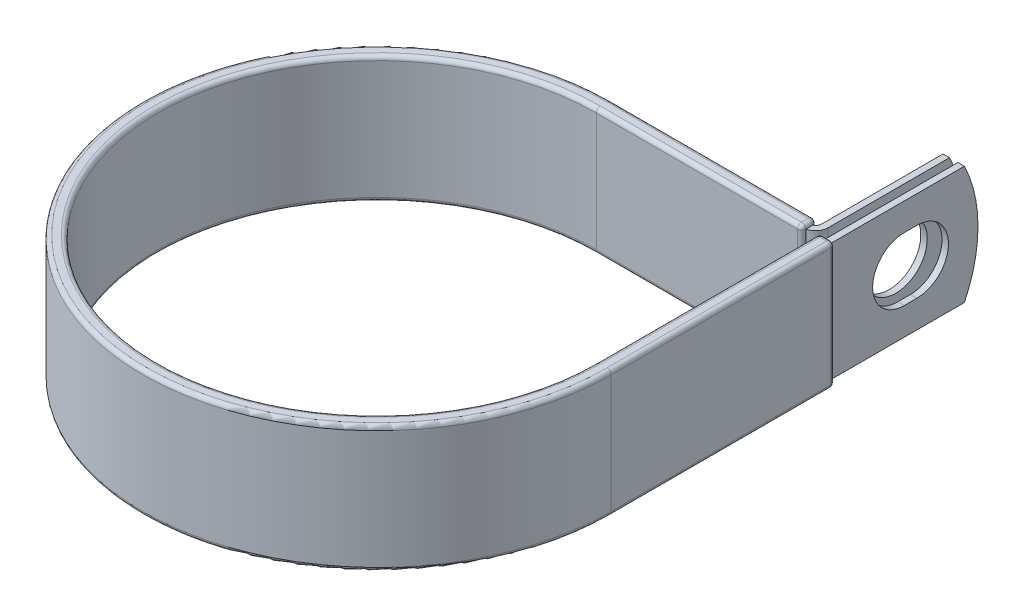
ISO-10303-21;
HEADER;
FILE_DESCRIPTION(('STEP AP214'),'2;1');
FILE_NAME('part.step','',(''),(''),'','','');
FILE_SCHEMA(('AUTOMOTIVE_DESIGN { 1 0 10303 214 1 1 1 1 }'));
ENDSEC;
DATA;
#1=APPLICATION_CONTEXT('core data for automotive mechanical design processes');
#2=APPLICATION_PROTOCOL_DEFINITION('international standard','automotive_design',2000,#1);
#3=PRODUCT_CONTEXT('',#1,'mechanical');
#4=PRODUCT('Part','Part','',(#3));
#5=PRODUCT_RELATED_PRODUCT_CATEGORY('part','',(#4));
#6=PRODUCT_DEFINITION_FORMATION('','',#4);
#7=PRODUCT_DEFINITION_CONTEXT('part definition',#1,'design');
#8=PRODUCT_DEFINITION('design','',#6,#7);
#9=PRODUCT_DEFINITION_SHAPE('','',#8);
#10=(LENGTH_UNIT() NAMED_UNIT(*) SI_UNIT(.MILLI.,.METRE.));
#11=(NAMED_UNIT(*) PLANE_ANGLE_UNIT() SI_UNIT($,.RADIAN.));
#12=(NAMED_UNIT(*) SI_UNIT($,.STERADIAN.) SOLID_ANGLE_UNIT());
#13=UNCERTAINTY_MEASURE_WITH_UNIT(LENGTH_MEASURE(1.E-05),#10,'distance_accuracy_value','');
#14=(GEOMETRIC_REPRESENTATION_CONTEXT(3) GLOBAL_UNCERTAINTY_ASSIGNED_CONTEXT((#13)) GLOBAL_UNIT_ASSIGNED_CONTEXT((#10,
#11,#12)) REPRESENTATION_CONTEXT('',''));
#15=CARTESIAN_POINT('',(0.,0.,0.));
#16=DIRECTION('',(0.,0.,1.));
#17=DIRECTION('',(1.,0.,0.));
#18=AXIS2_PLACEMENT_3D('',#15,#16,#17);
#19=CARTESIAN_POINT('',(40.49395,11.1125,-69.85));
#20=DIRECTION('',(1.,0.,0.));
#21=DIRECTION('',(0.,0.,-1.));
#22=AXIS2_PLACEMENT_3D('',#19,#20,#21);
#23=PLANE('',#22);
#24=CARTESIAN_POINT('',(40.49395,0.,-57.15));
#25=DIRECTION('',(1.,0.,0.));
#26=DIRECTION('',(0.,0.,-1.));
#27=AXIS2_PLACEMENT_3D('',#24,#25,#26);
#28=CIRCLE('',#27,5.9436);
#29=CARTESIAN_POINT('',(40.49395,0.,-63.0936));
#30=VERTEX_POINT('',#29);
#31=EDGE_CURVE('E442',#30,#30,#28,.F.);
#32=ORIENTED_EDGE('',*,*,#31,.T.);
#33=EDGE_LOOP('',(#32));
#34=FACE_BOUND('',#33,.T.);
#35=DIRECTION('',(0.,0.,1.));
#36=VECTOR('',#35,1.);
#37=CARTESIAN_POINT('',(40.49395,-11.1125,-69.85));
#38=LINE('',#37,#36);
#39=CARTESIAN_POINT('',(40.49395,-11.1125,-67.2901476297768));
#40=VERTEX_POINT('',#39);
#41=CARTESIAN_POINT('',(40.49395,-11.1125,-44.44619));
#42=VERTEX_POINT('',#41);
#43=EDGE_CURVE('E464',#40,#42,#38,.T.);
#44=ORIENTED_EDGE('',*,*,#43,.F.);
#45=CARTESIAN_POINT('',(40.49395,0.,-44.45));
#46=DIRECTION('',(1.,0.,0.));
#47=DIRECTION('',(0.,0.,-1.));
#48=AXIS2_PLACEMENT_3D('',#45,#46,#47);
#49=CIRCLE('',#48,25.4);
#50=CARTESIAN_POINT('',(40.49395,11.1125,-67.2901476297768));
#51=VERTEX_POINT('',#50);
#52=EDGE_CURVE('E401',#40,#51,#49,.T.);
#53=ORIENTED_EDGE('',*,*,#52,.T.);
#54=DIRECTION('',(0.,0.,1.));
#55=VECTOR('',#54,1.);
#56=CARTESIAN_POINT('',(40.49395,11.1125,-69.85));
#57=LINE('',#56,#55);
#58=CARTESIAN_POINT('',(40.49395,11.1125,-44.44619));
#59=VERTEX_POINT('',#58);
#60=EDGE_CURVE('E454',#51,#59,#57,.T.);
#61=ORIENTED_EDGE('',*,*,#60,.T.);
#62=DIRECTION('',(0.,-1.,0.));
#63=VECTOR('',#62,1.);
#64=CARTESIAN_POINT('',(40.49395,11.1125,-44.44619));
#65=LINE('',#64,#63);
#66=EDGE_CURVE('E471',#59,#42,#65,.T.);
#67=ORIENTED_EDGE('',*,*,#66,.T.);
#68=EDGE_LOOP('',(#44,#53,#61,#67));
#69=FACE_BOUND('',#68,.T.);
#70=ADVANCED_FACE('F36',(#34,#69),#23,.T.);
#71=CARTESIAN_POINT('',(39.27475,11.1125,-69.85));
#72=DIRECTION('',(1.,0.,0.));
#73=DIRECTION('',(0.,0.,-1.));
#74=AXIS2_PLACEMENT_3D('',#71,#72,#73);
#75=PLANE('',#74);
#76=CARTESIAN_POINT('',(39.27475,0.,-57.15));
#77=DIRECTION('',(-1.,0.,0.));
#78=DIRECTION('',(0.,0.,1.));
#79=AXIS2_PLACEMENT_3D('',#76,#77,#78);
#80=CIRCLE('',#79,5.9436);
#81=CARTESIAN_POINT('',(39.27475,0.,-51.2064));
#82=VERTEX_POINT('',#81);
#83=EDGE_CURVE('E439',#82,#82,#80,.T.);
#84=ORIENTED_EDGE('',*,*,#83,.F.);
#85=EDGE_LOOP('',(#84));
#86=FACE_BOUND('',#85,.T.);
#87=CARTESIAN_POINT('',(39.27475,0.,-44.45));
#88=DIRECTION('',(-1.,0.,0.));
#89=DIRECTION('',(0.,0.,1.));
#90=AXIS2_PLACEMENT_3D('',#87,#88,#89);
#91=CIRCLE('',#90,25.4);
#92=CARTESIAN_POINT('',(39.27475,11.1125,-67.2901476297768));
#93=VERTEX_POINT('',#92);
#94=CARTESIAN_POINT('',(39.27475,-11.1125,-67.2901476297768));
#95=VERTEX_POINT('',#94);
#96=EDGE_CURVE('E393',#93,#95,#91,.T.);
#97=ORIENTED_EDGE('',*,*,#96,.T.);
#98=DIRECTION('',(0.,0.,1.));
#99=VECTOR('',#98,1.);
#100=CARTESIAN_POINT('',(39.27475,-11.1125,-69.85));
#101=LINE('',#100,#99);
#102=CARTESIAN_POINT('',(39.27475,-11.1125,-44.44619));
#103=VERTEX_POINT('',#102);
#104=EDGE_CURVE('E466',#95,#103,#101,.T.);
#105=ORIENTED_EDGE('',*,*,#104,.T.);
#106=DIRECTION('',(0.,-1.,0.));
#107=VECTOR('',#106,1.);
#108=CARTESIAN_POINT('',(39.27475,11.1125,-44.44619));
#109=LINE('',#108,#107);
#110=CARTESIAN_POINT('',(39.27475,11.1125,-44.44619));
#111=VERTEX_POINT('',#110);
#112=EDGE_CURVE('E459',#111,#103,#109,.T.);
#113=ORIENTED_EDGE('',*,*,#112,.F.);
#114=DIRECTION('',(0.,0.,1.));
#115=VECTOR('',#114,1.);
#116=CARTESIAN_POINT('',(39.27475,11.1125,-69.85));
#117=LINE('',#116,#115);
#118=EDGE_CURVE('E456',#93,#111,#117,.T.);
#119=ORIENTED_EDGE('',*,*,#118,.F.);
#120=EDGE_LOOP('',(#97,#105,#113,#119));
#121=FACE_BOUND('',#120,.T.);
#122=ADVANCED_FACE('F770',(#86,#121),#75,.F.);
#123=CARTESIAN_POINT('',(0.,-11.1125,0.));
#124=DIRECTION('',(0.,1.,0.));
#125=DIRECTION('',(1.,0.,0.));
#126=AXIS2_PLACEMENT_3D('',#123,#124,#125);
#127=PLANE('',#126);
#128=CARTESIAN_POINT('',(38.11651,-11.1125,-44.44619));
#129=DIRECTION('',(0.,-1.,0.));
#130=DIRECTION('',(0.,0.,1.));
#131=AXIS2_PLACEMENT_3D('',#128,#129,#130);
#132=CIRCLE('',#131,2.37744);
#133=CARTESIAN_POINT('',(38.6397500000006,-11.1125,-42.1270434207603));
#134=VERTEX_POINT('',#133);
#135=EDGE_CURVE('E461',#42,#134,#132,.T.);
#136=ORIENTED_EDGE('',*,*,#135,.T.);
#137=DIRECTION('',(0.,0.,-1.));
#138=VECTOR('',#137,1.);
#139=CARTESIAN_POINT('',(38.6397500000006,-11.1125,-43.28795));
#140=LINE('',#139,#138);
#141=CARTESIAN_POINT('',(38.6397500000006,-11.1125,-43.3197));
#142=VERTEX_POINT('',#141);
#143=EDGE_CURVE('E350',#134,#142,#140,.T.);
#144=ORIENTED_EDGE('',*,*,#143,.T.);
#145=CARTESIAN_POINT('',(37.8777500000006,-11.1125,-43.3197));
#146=DIRECTION('',(0.,1.,0.));
#147=DIRECTION('',(0.,0.,1.));
#148=AXIS2_PLACEMENT_3D('',#145,#146,#147);
#149=CIRCLE('',#148,0.762);
#150=CARTESIAN_POINT('',(38.6343610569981,-11.1125,-43.4101638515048));
#151=VERTEX_POINT('',#150);
#152=EDGE_CURVE('E536',#142,#151,#149,.T.);
#153=ORIENTED_EDGE('',*,*,#152,.T.);
#154=CARTESIAN_POINT('',(38.11651,-11.1125,-44.44619));
#155=DIRECTION('',(0.,1.,0.));
#156=DIRECTION('',(1.,0.,0.));
#157=AXIS2_PLACEMENT_3D('',#154,#155,#156);
#158=CIRCLE('',#157,1.15824);
#159=EDGE_CURVE('E59',#103,#151,#158,.F.);
#160=ORIENTED_EDGE('',*,*,#159,.F.);
#161=ORIENTED_EDGE('',*,*,#104,.F.);
#162=DIRECTION('',(-1.,0.,0.));
#163=VECTOR('',#162,1.);
#164=CARTESIAN_POINT('',(43.28795,-11.1125,-67.2901476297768));
#165=LINE('',#164,#163);
#166=EDGE_CURVE('E480',#40,#95,#165,.T.);
#167=ORIENTED_EDGE('',*,*,#166,.F.);
#168=ORIENTED_EDGE('',*,*,#43,.T.);
#169=EDGE_LOOP('',(#136,#144,#153,#160,#161,#167,#168));
#170=FACE_BOUND('',#169,.T.);
#171=ADVANCED_FACE('F776',(#170),#127,.F.);
#172=CARTESIAN_POINT('',(0.,11.1125,0.));
#173=DIRECTION('',(0.,1.,0.));
#174=DIRECTION('',(1.,0.,0.));
#175=AXIS2_PLACEMENT_3D('',#172,#173,#174);
#176=PLANE('',#175);
#177=DIRECTION('',(0.,0.,-1.));
#178=VECTOR('',#177,1.);
#179=CARTESIAN_POINT('',(38.63975,11.1125,5.42005866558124E-13));
#180=LINE('',#179,#178);
#181=CARTESIAN_POINT('',(38.6397500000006,11.1125,-42.1270434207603));
#182=VERTEX_POINT('',#181);
#183=CARTESIAN_POINT('',(38.6397500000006,11.1125,-43.3197));
#184=VERTEX_POINT('',#183);
#185=EDGE_CURVE('E387',#182,#184,#180,.T.);
#186=ORIENTED_EDGE('',*,*,#185,.F.);
#187=CARTESIAN_POINT('',(38.11651,11.1125,-44.44619));
#188=DIRECTION('',(0.,-1.,0.));
#189=DIRECTION('',(0.,0.,1.));
#190=AXIS2_PLACEMENT_3D('',#187,#188,#189);
#191=CIRCLE('',#190,2.37744);
#192=EDGE_CURVE('E451',#59,#182,#191,.T.);
#193=ORIENTED_EDGE('',*,*,#192,.F.);
#194=ORIENTED_EDGE('',*,*,#60,.F.);
#195=DIRECTION('',(-1.,0.,0.));
#196=VECTOR('',#195,1.);
#197=CARTESIAN_POINT('',(43.28795,11.1125,-67.2901476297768));
#198=LINE('',#197,#196);
#199=EDGE_CURVE('E477',#51,#93,#198,.T.);
#200=ORIENTED_EDGE('',*,*,#199,.T.);
#201=ORIENTED_EDGE('',*,*,#118,.T.);
#202=CARTESIAN_POINT('',(38.11651,11.1125,-44.44619));
#203=DIRECTION('',(0.,1.,0.));
#204=DIRECTION('',(1.,0.,0.));
#205=AXIS2_PLACEMENT_3D('',#202,#203,#204);
#206=CIRCLE('',#205,1.15824);
#207=CARTESIAN_POINT('',(38.6343610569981,11.1125,-43.4101638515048));
#208=VERTEX_POINT('',#207);
#209=EDGE_CURVE('E52',#111,#208,#206,.F.);
#210=ORIENTED_EDGE('',*,*,#209,.T.);
#211=CARTESIAN_POINT('',(37.8777500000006,11.1125,-43.3197));
#212=DIRECTION('',(0.,1.,0.));
#213=DIRECTION('',(0.,0.,1.));
#214=AXIS2_PLACEMENT_3D('',#211,#212,#213);
#215=CIRCLE('',#214,0.762);
#216=EDGE_CURVE('E11',#208,#184,#215,.F.);
#217=ORIENTED_EDGE('',*,*,#216,.T.);
#218=EDGE_LOOP('',(#186,#193,#194,#200,#201,#210,#217));
#219=FACE_BOUND('',#218,.T.);
#220=ADVANCED_FACE('F784',(#219),#176,.T.);
#221=CARTESIAN_POINT('',(38.11651,11.1125,-44.44619));
#222=DIRECTION('',(0.,-1.,0.));
#223=DIRECTION('',(0.,0.,-1.));
#224=AXIS2_PLACEMENT_3D('',#221,#222,#223);
#225=CYLINDRICAL_SURFACE('',#224,2.37744);
#226=ORIENTED_EDGE('',*,*,#135,.F.);
#227=ORIENTED_EDGE('',*,*,#66,.F.);
#228=ORIENTED_EDGE('',*,*,#192,.T.);
#229=CARTESIAN_POINT('',(38.11651,11.1125,-44.44619));
#230=DIRECTION('',(0.,-1.,0.));
#231=DIRECTION('',(0.,0.,-1.));
#232=AXIS2_PLACEMENT_3D('',#229,#230,#231);
#233=CIRCLE('',#232,2.37744);
#234=CARTESIAN_POINT('',(38.11651,11.1125,-42.06875));
#235=VERTEX_POINT('',#234);
#236=EDGE_CURVE('E384',#235,#182,#233,.F.);
#237=ORIENTED_EDGE('',*,*,#236,.F.);
#238=DIRECTION('',(0.,-1.,0.));
#239=VECTOR('',#238,1.);
#240=CARTESIAN_POINT('',(38.11651,11.1125,-42.06875));
#241=LINE('',#240,#239);
#242=CARTESIAN_POINT('',(38.11651,-11.1125,-42.06875));
#243=VERTEX_POINT('',#242);
#244=EDGE_CURVE('E474',#235,#243,#241,.T.);
#245=ORIENTED_EDGE('',*,*,#244,.T.);
#246=CARTESIAN_POINT('',(38.11651,-11.1125,-44.44619));
#247=DIRECTION('',(0.,1.,0.));
#248=DIRECTION('',(0.,0.,1.));
#249=AXIS2_PLACEMENT_3D('',#246,#247,#248);
#250=CIRCLE('',#249,2.37744);
#251=EDGE_CURVE('E382',#134,#243,#250,.F.);
#252=ORIENTED_EDGE('',*,*,#251,.F.);
#253=EDGE_LOOP('',(#226,#227,#228,#237,#245,#252));
#254=FACE_BOUND('',#253,.T.);
#255=ADVANCED_FACE('F781',(#254),#225,.T.);
#256=CARTESIAN_POINT('',(38.11651,11.1125,-44.44619));
#257=DIRECTION('',(0.,-1.,0.));
#258=DIRECTION('',(0.,0.,-1.));
#259=AXIS2_PLACEMENT_3D('',#256,#257,#258);
#260=CYLINDRICAL_SURFACE('',#259,1.15824);
#261=ORIENTED_EDGE('',*,*,#159,.T.);
#262=DIRECTION('',(0.,1.,0.));
#263=VECTOR('',#262,1.);
#264=CARTESIAN_POINT('',(38.6343610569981,-11.1125,-43.4101638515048));
#265=LINE('',#264,#263);
#266=EDGE_CURVE('E45',#151,#208,#265,.T.);
#267=ORIENTED_EDGE('',*,*,#266,.T.);
#268=ORIENTED_EDGE('',*,*,#209,.F.);
#269=ORIENTED_EDGE('',*,*,#112,.T.);
#270=EDGE_LOOP('',(#261,#267,#268,#269));
#271=FACE_BOUND('',#270,.T.);
#272=ADVANCED_FACE('F783',(#271),#260,.F.);
#273=CARTESIAN_POINT('',(57.3049894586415,0.,-57.15));
#274=DIRECTION('',(-1.,0.,0.));
#275=DIRECTION('',(0.,0.,1.));
#276=AXIS2_PLACEMENT_3D('',#273,#274,#275);
#277=CYLINDRICAL_SURFACE('',#276,5.9436);
#278=ORIENTED_EDGE('',*,*,#83,.T.);
#279=EDGE_LOOP('',(#278));
#280=FACE_BOUND('',#279,.T.);
#281=ORIENTED_EDGE('',*,*,#31,.F.);
#282=EDGE_LOOP('',(#281));
#283=FACE_BOUND('',#282,.T.);
#284=ADVANCED_FACE('F790',(#280,#283),#277,.F.);
#285=CARTESIAN_POINT('',(43.28795,0.,-44.45));
#286=DIRECTION('',(-1.,0.,0.));
#287=DIRECTION('',(0.,0.,1.));
#288=AXIS2_PLACEMENT_3D('',#285,#286,#287);
#289=CYLINDRICAL_SURFACE('',#288,25.4);
#290=ORIENTED_EDGE('',*,*,#52,.F.);
#291=ORIENTED_EDGE('',*,*,#166,.T.);
#292=ORIENTED_EDGE('',*,*,#96,.F.);
#293=ORIENTED_EDGE('',*,*,#199,.F.);
#294=EDGE_LOOP('',(#290,#291,#292,#293));
#295=FACE_BOUND('',#294,.T.);
#296=ADVANCED_FACE('F841',(#295),#289,.T.);
#297=CARTESIAN_POINT('',(5.9010499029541E-13,-11.1125,-42.06875));
#298=DIRECTION('',(0.,0.,1.));
#299=DIRECTION('',(1.,0.,0.));
#300=AXIS2_PLACEMENT_3D('',#297,#298,#299);
#301=PLANE('',#300);
#302=DIRECTION('',(1.,0.,0.));
#303=VECTOR('',#302,1.);
#304=CARTESIAN_POINT('',(5.9010499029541E-13,-11.1125,-42.06875));
#305=LINE('',#304,#303);
#306=CARTESIAN_POINT('',(38.6397500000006,-11.1125,-42.06875));
#307=VERTEX_POINT('',#306);
#308=EDGE_CURVE('E357',#243,#307,#305,.T.);
#309=ORIENTED_EDGE('',*,*,#308,.F.);
#310=ORIENTED_EDGE('',*,*,#244,.F.);
#311=DIRECTION('',(1.,0.,0.));
#312=VECTOR('',#311,1.);
#313=CARTESIAN_POINT('',(5.9010499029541E-13,11.1125,-42.06875));
#314=LINE('',#313,#312);
#315=CARTESIAN_POINT('',(38.6397500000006,11.1125,-42.06875));
#316=VERTEX_POINT('',#315);
#317=EDGE_CURVE('E359',#235,#316,#314,.T.);
#318=ORIENTED_EDGE('',*,*,#317,.T.);
#319=DIRECTION('',(0.,-1.,0.));
#320=VECTOR('',#319,1.);
#321=CARTESIAN_POINT('',(38.6397500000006,-11.1125,-42.06875));
#322=LINE('',#321,#320);
#323=EDGE_CURVE('E289',#316,#307,#322,.T.);
#324=ORIENTED_EDGE('',*,*,#323,.T.);
#325=EDGE_LOOP('',(#309,#310,#318,#324));
#326=FACE_BOUND('',#325,.T.);
#327=ADVANCED_FACE('F813',(#326),#301,.F.);
#328=CARTESIAN_POINT('',(38.6397500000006,-11.14425,-42.037));
#329=DIRECTION('',(1.,0.,0.));
#330=DIRECTION('',(0.,0.,-1.));
#331=AXIS2_PLACEMENT_3D('',#328,#329,#330);
#332=PLANE('',#331);
#333=DIRECTION('',(0.,0.,-1.));
#334=VECTOR('',#333,1.);
#335=CARTESIAN_POINT('',(38.6397500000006,-11.14425,-43.3197));
#336=LINE('',#335,#334);
#337=CARTESIAN_POINT('',(38.6397500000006,-11.14425,-42.037));
#338=VERTEX_POINT('',#337);
#339=CARTESIAN_POINT('',(38.6397500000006,-11.14425,-43.3197));
#340=VERTEX_POINT('',#339);
#341=EDGE_CURVE('E490',#338,#340,#336,.T.);
#342=ORIENTED_EDGE('',*,*,#341,.T.);
#343=DIRECTION('',(0.,1.,0.));
#344=VECTOR('',#343,1.);
#345=CARTESIAN_POINT('',(38.6397500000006,-11.14425,-43.3197));
#346=LINE('',#345,#344);
#347=EDGE_CURVE('E494',#340,#142,#346,.T.);
#348=ORIENTED_EDGE('',*,*,#347,.T.);
#349=ORIENTED_EDGE('',*,*,#143,.F.);
#350=EDGE_CURVE('E351',#307,#134,#140,.T.);
#351=ORIENTED_EDGE('',*,*,#350,.F.);
#352=ORIENTED_EDGE('',*,*,#323,.F.);
#353=DIRECTION('',(0.,0.,1.));
#354=VECTOR('',#353,1.);
#355=CARTESIAN_POINT('',(38.6397500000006,11.1125,-42.06875));
#356=LINE('',#355,#354);
#357=EDGE_CURVE('E354',#182,#316,#356,.T.);
#358=ORIENTED_EDGE('',*,*,#357,.F.);
#359=ORIENTED_EDGE('',*,*,#185,.T.);
#360=DIRECTION('',(0.,1.,0.));
#361=VECTOR('',#360,1.);
#362=CARTESIAN_POINT('',(38.6397500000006,-11.14425,-43.3197));
#363=LINE('',#362,#361);
#364=CARTESIAN_POINT('',(38.6397500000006,11.14425,-43.3197));
#365=VERTEX_POINT('',#364);
#366=EDGE_CURVE('E492',#184,#365,#363,.T.);
#367=ORIENTED_EDGE('',*,*,#366,.T.);
#368=DIRECTION('',(0.,0.,1.));
#369=VECTOR('',#368,1.);
#370=CARTESIAN_POINT('',(38.6397500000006,11.14425,-42.037));
#371=LINE('',#370,#369);
#372=CARTESIAN_POINT('',(38.6397500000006,11.14425,-42.037));
#373=VERTEX_POINT('',#372);
#374=EDGE_CURVE('E486',#365,#373,#371,.T.);
#375=ORIENTED_EDGE('',*,*,#374,.T.);
#376=DIRECTION('',(0.,-1.,0.));
#377=VECTOR('',#376,1.);
#378=CARTESIAN_POINT('',(38.6397500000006,-11.14425,-42.037));
#379=LINE('',#378,#377);
#380=EDGE_CURVE('E488',#373,#338,#379,.T.);
#381=ORIENTED_EDGE('',*,*,#380,.T.);
#382=EDGE_LOOP('',(#342,#348,#349,#351,#352,#358,#359,#367,#375,#381));
#383=FACE_BOUND('',#382,.T.);
#384=ADVANCED_FACE('F809',(#383),#332,.T.);
#385=CARTESIAN_POINT('',(6.07652263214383E-13,-11.14425,-43.3197));
#386=DIRECTION('',(1.,0.,0.));
#387=DIRECTION('',(0.,0.,-1.));
#388=AXIS2_PLACEMENT_3D('',#385,#386,#387);
#389=CYLINDRICAL_SURFACE('',#388,0.761999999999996);
#390=DIRECTION('',(1.,0.,0.));
#391=VECTOR('',#390,1.);
#392=CARTESIAN_POINT('',(6.18340957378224E-13,-11.14425,-44.0817));
#393=LINE('',#392,#391);
#394=CARTESIAN_POINT('',(6.18340957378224E-13,-11.14425,-44.0817));
#395=VERTEX_POINT('',#394);
#396=CARTESIAN_POINT('',(37.8777500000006,-11.14425,-44.0817));
#397=VERTEX_POINT('',#396);
#398=EDGE_CURVE('E376',#395,#397,#393,.T.);
#399=ORIENTED_EDGE('',*,*,#398,.T.);
#400=CARTESIAN_POINT('',(37.8777500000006,-11.14425,-43.3197));
#401=DIRECTION('',(1.,0.,0.));
#402=DIRECTION('',(0.,0.,-1.));
#403=AXIS2_PLACEMENT_3D('',#400,#401,#402);
#404=CIRCLE('',#403,0.761999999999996);
#405=CARTESIAN_POINT('',(37.8777500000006,-11.90625,-43.3197));
#406=VERTEX_POINT('',#405);
#407=EDGE_CURVE('E499',#397,#406,#404,.F.);
#408=ORIENTED_EDGE('',*,*,#407,.T.);
#409=DIRECTION('',(1.,0.,0.));
#410=VECTOR('',#409,1.);
#411=CARTESIAN_POINT('',(6.07652263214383E-13,-11.90625,-43.3197));
#412=LINE('',#411,#410);
#413=CARTESIAN_POINT('',(6.07652263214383E-13,-11.90625,-43.3197));
#414=VERTEX_POINT('',#413);
#415=EDGE_CURVE('E379',#414,#406,#412,.T.);
#416=ORIENTED_EDGE('',*,*,#415,.F.);
#417=CARTESIAN_POINT('',(6.07652263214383E-13,-11.14425,-43.3197));
#418=DIRECTION('',(1.,0.,0.));
#419=DIRECTION('',(0.,0.,1.));
#420=AXIS2_PLACEMENT_3D('',#417,#418,#419);
#421=CIRCLE('',#420,0.761999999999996);
#422=EDGE_CURVE('E327',#414,#395,#421,.T.);
#423=ORIENTED_EDGE('',*,*,#422,.T.);
#424=EDGE_LOOP('',(#399,#408,#416,#423));
#425=FACE_BOUND('',#424,.T.);
#426=ADVANCED_FACE('F652',(#425),#389,.T.);
#427=CARTESIAN_POINT('',(6.18340957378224E-13,11.14425,-44.0817));
#428=DIRECTION('',(0.,0.,-1.));
#429=DIRECTION('',(0.,1.,0.));
#430=AXIS2_PLACEMENT_3D('',#427,#428,#429);
#431=PLANE('',#430);
#432=DIRECTION('',(1.,0.,0.));
#433=VECTOR('',#432,1.);
#434=CARTESIAN_POINT('',(6.18340957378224E-13,11.14425,-44.0817));
#435=LINE('',#434,#433);
#436=CARTESIAN_POINT('',(6.18340957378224E-13,11.14425,-44.0817));
#437=VERTEX_POINT('',#436);
#438=CARTESIAN_POINT('',(37.8777500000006,11.14425,-44.0817));
#439=VERTEX_POINT('',#438);
#440=EDGE_CURVE('E373',#437,#439,#435,.T.);
#441=ORIENTED_EDGE('',*,*,#440,.T.);
#442=DIRECTION('',(0.,1.,0.));
#443=VECTOR('',#442,1.);
#444=CARTESIAN_POINT('',(37.8777500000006,11.14425,-44.0817));
#445=LINE('',#444,#443);
#446=EDGE_CURVE('E497',#439,#397,#445,.F.);
#447=ORIENTED_EDGE('',*,*,#446,.T.);
#448=ORIENTED_EDGE('',*,*,#398,.F.);
#449=DIRECTION('',(0.,1.,0.));
#450=VECTOR('',#449,1.);
#451=CARTESIAN_POINT('',(6.18340957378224E-13,11.14425,-44.0817));
#452=LINE('',#451,#450);
#453=EDGE_CURVE('E324',#395,#437,#452,.T.);
#454=ORIENTED_EDGE('',*,*,#453,.T.);
#455=EDGE_LOOP('',(#441,#447,#448,#454));
#456=FACE_BOUND('',#455,.T.);
#457=ADVANCED_FACE('F658',(#456),#431,.T.);
#458=CARTESIAN_POINT('',(6.07652263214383E-13,11.14425,-43.3197));
#459=DIRECTION('',(1.,0.,0.));
#460=DIRECTION('',(0.,0.,-1.));
#461=AXIS2_PLACEMENT_3D('',#458,#459,#460);
#462=CYLINDRICAL_SURFACE('',#461,0.762000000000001);
#463=DIRECTION('',(1.,0.,0.));
#464=VECTOR('',#463,1.);
#465=CARTESIAN_POINT('',(6.07652263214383E-13,11.90625,-43.3197));
#466=LINE('',#465,#464);
#467=CARTESIAN_POINT('',(6.07652263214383E-13,11.90625,-43.3197));
#468=VERTEX_POINT('',#467);
#469=CARTESIAN_POINT('',(37.8777500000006,11.90625,-43.3197));
#470=VERTEX_POINT('',#469);
#471=EDGE_CURVE('E370',#468,#470,#466,.T.);
#472=ORIENTED_EDGE('',*,*,#471,.T.);
#473=CARTESIAN_POINT('',(37.8777500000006,11.14425,-43.3197));
#474=DIRECTION('',(1.,0.,0.));
#475=DIRECTION('',(0.,0.,-1.));
#476=AXIS2_PLACEMENT_3D('',#473,#474,#475);
#477=CIRCLE('',#476,0.762000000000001);
#478=EDGE_CURVE('E483',#470,#439,#477,.F.);
#479=ORIENTED_EDGE('',*,*,#478,.T.);
#480=ORIENTED_EDGE('',*,*,#440,.F.);
#481=CARTESIAN_POINT('',(6.07652263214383E-13,11.14425,-43.3197));
#482=DIRECTION('',(1.,0.,0.));
#483=DIRECTION('',(0.,0.,1.));
#484=AXIS2_PLACEMENT_3D('',#481,#482,#483);
#485=CIRCLE('',#484,0.762000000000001);
#486=EDGE_CURVE('E321',#437,#468,#485,.T.);
#487=ORIENTED_EDGE('',*,*,#486,.T.);
#488=EDGE_LOOP('',(#472,#479,#480,#487));
#489=FACE_BOUND('',#488,.T.);
#490=ADVANCED_FACE('F662',(#489),#462,.T.);
#491=CARTESIAN_POINT('',(5.89659628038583E-13,11.14425,-42.037));
#492=DIRECTION('',(1.,0.,0.));
#493=DIRECTION('',(0.,0.,-1.));
#494=AXIS2_PLACEMENT_3D('',#491,#492,#493);
#495=CYLINDRICAL_SURFACE('',#494,0.762);
#496=DIRECTION('',(1.,0.,0.));
#497=VECTOR('',#496,1.);
#498=CARTESIAN_POINT('',(5.78970933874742E-13,11.14425,-41.275));
#499=LINE('',#498,#497);
#500=CARTESIAN_POINT('',(5.78970933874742E-13,11.14425,-41.275));
#501=VERTEX_POINT('',#500);
#502=CARTESIAN_POINT('',(37.8777500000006,11.14425,-41.275));
#503=VERTEX_POINT('',#502);
#504=EDGE_CURVE('E364',#501,#503,#499,.T.);
#505=ORIENTED_EDGE('',*,*,#504,.T.);
#506=CARTESIAN_POINT('',(37.8777500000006,11.14425,-42.037));
#507=DIRECTION('',(1.,0.,0.));
#508=DIRECTION('',(0.,0.,-1.));
#509=AXIS2_PLACEMENT_3D('',#506,#507,#508);
#510=CIRCLE('',#509,0.762);
#511=CARTESIAN_POINT('',(37.8777500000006,11.90625,-42.037));
#512=VERTEX_POINT('',#511);
#513=EDGE_CURVE('E509',#503,#512,#510,.F.);
#514=ORIENTED_EDGE('',*,*,#513,.T.);
#515=DIRECTION('',(1.,0.,0.));
#516=VECTOR('',#515,1.);
#517=CARTESIAN_POINT('',(5.89659628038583E-13,11.90625,-42.037));
#518=LINE('',#517,#516);
#519=CARTESIAN_POINT('',(5.89659628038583E-13,11.90625,-42.037));
#520=VERTEX_POINT('',#519);
#521=EDGE_CURVE('E367',#520,#512,#518,.T.);
#522=ORIENTED_EDGE('',*,*,#521,.F.);
#523=CARTESIAN_POINT('',(5.89659628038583E-13,11.14425,-42.037));
#524=DIRECTION('',(1.,0.,0.));
#525=DIRECTION('',(0.,0.,1.));
#526=AXIS2_PLACEMENT_3D('',#523,#524,#525);
#527=CIRCLE('',#526,0.762);
#528=EDGE_CURVE('E318',#520,#501,#527,.T.);
#529=ORIENTED_EDGE('',*,*,#528,.T.);
#530=EDGE_LOOP('',(#505,#514,#522,#529));
#531=FACE_BOUND('',#530,.T.);
#532=ADVANCED_FACE('F703',(#531),#495,.T.);
#533=CARTESIAN_POINT('',(5.78970933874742E-13,-11.14425,-41.275));
#534=DIRECTION('',(0.,0.,1.));
#535=DIRECTION('',(0.,-1.,0.));
#536=AXIS2_PLACEMENT_3D('',#533,#534,#535);
#537=PLANE('',#536);
#538=DIRECTION('',(1.,0.,0.));
#539=VECTOR('',#538,1.);
#540=CARTESIAN_POINT('',(5.78970933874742E-13,-11.14425,-41.275));
#541=LINE('',#540,#539);
#542=CARTESIAN_POINT('',(5.78970933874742E-13,-11.14425,-41.275));
#543=VERTEX_POINT('',#542);
#544=CARTESIAN_POINT('',(37.8777500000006,-11.14425,-41.275));
#545=VERTEX_POINT('',#544);
#546=EDGE_CURVE('E361',#543,#545,#541,.T.);
#547=ORIENTED_EDGE('',*,*,#546,.T.);
#548=DIRECTION('',(0.,-1.,0.));
#549=VECTOR('',#548,1.);
#550=CARTESIAN_POINT('',(37.8777500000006,-11.14425,-41.275));
#551=LINE('',#550,#549);
#552=EDGE_CURVE('E507',#545,#503,#551,.F.);
#553=ORIENTED_EDGE('',*,*,#552,.T.);
#554=ORIENTED_EDGE('',*,*,#504,.F.);
#555=DIRECTION('',(0.,-1.,0.));
#556=VECTOR('',#555,1.);
#557=CARTESIAN_POINT('',(5.78970933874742E-13,-11.14425,-41.275));
#558=LINE('',#557,#556);
#559=EDGE_CURVE('E309',#501,#543,#558,.T.);
#560=ORIENTED_EDGE('',*,*,#559,.T.);
#561=EDGE_LOOP('',(#547,#553,#554,#560));
#562=FACE_BOUND('',#561,.T.);
#563=ADVANCED_FACE('F701',(#562),#537,.T.);
#564=CARTESIAN_POINT('',(5.89659628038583E-13,-11.14425,-42.037));
#565=DIRECTION('',(1.,0.,0.));
#566=DIRECTION('',(0.,0.,-1.));
#567=AXIS2_PLACEMENT_3D('',#564,#565,#566);
#568=CYLINDRICAL_SURFACE('',#567,0.762000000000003);
#569=DIRECTION('',(1.,0.,0.));
#570=VECTOR('',#569,1.);
#571=CARTESIAN_POINT('',(5.89659628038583E-13,-11.90625,-42.037));
#572=LINE('',#571,#570);
#573=CARTESIAN_POINT('',(5.89659628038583E-13,-11.90625,-42.037));
#574=VERTEX_POINT('',#573);
#575=CARTESIAN_POINT('',(37.8777500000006,-11.90625,-42.037));
#576=VERTEX_POINT('',#575);
#577=EDGE_CURVE('E285',#574,#576,#572,.T.);
#578=ORIENTED_EDGE('',*,*,#577,.T.);
#579=CARTESIAN_POINT('',(37.8777500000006,-11.14425,-42.037));
#580=DIRECTION('',(1.,0.,0.));
#581=DIRECTION('',(0.,0.,-1.));
#582=AXIS2_PLACEMENT_3D('',#579,#580,#581);
#583=CIRCLE('',#582,0.762000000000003);
#584=EDGE_CURVE('E505',#576,#545,#583,.F.);
#585=ORIENTED_EDGE('',*,*,#584,.T.);
#586=ORIENTED_EDGE('',*,*,#546,.F.);
#587=CARTESIAN_POINT('',(5.89659628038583E-13,-11.14425,-42.037));
#588=DIRECTION('',(1.,0.,0.));
#589=DIRECTION('',(0.,0.,-1.));
#590=AXIS2_PLACEMENT_3D('',#587,#588,#589);
#591=CIRCLE('',#590,0.762000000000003);
#592=EDGE_CURVE('E306',#543,#574,#591,.T.);
#593=ORIENTED_EDGE('',*,*,#592,.T.);
#594=EDGE_LOOP('',(#578,#585,#586,#593));
#595=FACE_BOUND('',#594,.T.);
#596=ADVANCED_FACE('F691',(#595),#568,.T.);
#597=CARTESIAN_POINT('',(0.,-11.14425,0.));
#598=DIRECTION('',(0.,-1.,0.));
#599=DIRECTION('',(0.,0.,-1.));
#600=AXIS2_PLACEMENT_3D('',#597,#598,#599);
#601=TOROIDAL_SURFACE('',#600,43.3197,0.761999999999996);
#602=CARTESIAN_POINT('',(43.3197,-11.14425,0.));
#603=DIRECTION('',(0.,0.,1.));
#604=DIRECTION('',(-1.,0.,0.));
#605=AXIS2_PLACEMENT_3D('',#602,#603,#604);
#606=CIRCLE('',#605,0.761999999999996);
#607=CARTESIAN_POINT('',(43.3197,-11.90625,0.));
#608=VERTEX_POINT('',#607);
#609=CARTESIAN_POINT('',(44.0817,-11.14425,0.));
#610=VERTEX_POINT('',#609);
#611=EDGE_CURVE('E300',#608,#610,#606,.T.);
#612=ORIENTED_EDGE('',*,*,#611,.T.);
#613=CARTESIAN_POINT('',(0.,-11.14425,0.));
#614=DIRECTION('',(0.,-1.,0.));
#615=DIRECTION('',(0.,0.,-1.));
#616=AXIS2_PLACEMENT_3D('',#613,#614,#615);
#617=CIRCLE('',#616,44.0817);
#618=EDGE_CURVE('E343',#610,#395,#617,.T.);
#619=ORIENTED_EDGE('',*,*,#618,.T.);
#620=ORIENTED_EDGE('',*,*,#422,.F.);
#621=CARTESIAN_POINT('',(0.,-11.90625,0.));
#622=DIRECTION('',(0.,-1.,0.));
#623=DIRECTION('',(0.,0.,-1.));
#624=AXIS2_PLACEMENT_3D('',#621,#622,#623);
#625=CIRCLE('',#624,43.3197);
#626=EDGE_CURVE('E290',#608,#414,#625,.T.);
#627=ORIENTED_EDGE('',*,*,#626,.F.);
#628=EDGE_LOOP('',(#612,#619,#620,#627));
#629=FACE_BOUND('',#628,.T.);
#630=ADVANCED_FACE('F649',(#629),#601,.T.);
#631=CARTESIAN_POINT('',(0.,11.1125,0.));
#632=DIRECTION('',(0.,-1.,0.));
#633=DIRECTION('',(0.,0.,-1.));
#634=AXIS2_PLACEMENT_3D('',#631,#632,#633);
#635=CYLINDRICAL_SURFACE('',#634,44.0817);
#636=DIRECTION('',(0.,1.,0.));
#637=VECTOR('',#636,1.);
#638=CARTESIAN_POINT('',(44.0817,11.14425,0.));
#639=LINE('',#638,#637);
#640=CARTESIAN_POINT('',(44.0817,11.14425,0.));
#641=VERTEX_POINT('',#640);
#642=EDGE_CURVE('E637',#610,#641,#639,.T.);
#643=ORIENTED_EDGE('',*,*,#642,.T.);
#644=CARTESIAN_POINT('',(0.,11.14425,0.));
#645=DIRECTION('',(0.,-1.,0.));
#646=DIRECTION('',(0.,0.,-1.));
#647=AXIS2_PLACEMENT_3D('',#644,#645,#646);
#648=CIRCLE('',#647,44.0817);
#649=EDGE_CURVE('E340',#641,#437,#648,.T.);
#650=ORIENTED_EDGE('',*,*,#649,.T.);
#651=ORIENTED_EDGE('',*,*,#453,.F.);
#652=ORIENTED_EDGE('',*,*,#618,.F.);
#653=EDGE_LOOP('',(#643,#650,#651,#652));
#654=FACE_BOUND('',#653,.T.);
#655=ADVANCED_FACE('F655',(#654),#635,.T.);
#656=CARTESIAN_POINT('',(0.,11.14425,0.));
#657=DIRECTION('',(0.,-1.,0.));
#658=DIRECTION('',(0.,0.,-1.));
#659=AXIS2_PLACEMENT_3D('',#656,#657,#658);
#660=TOROIDAL_SURFACE('',#659,43.3197,0.762000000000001);
#661=CARTESIAN_POINT('',(43.3197,11.14425,0.));
#662=DIRECTION('',(0.,0.,1.));
#663=DIRECTION('',(-1.,0.,0.));
#664=AXIS2_PLACEMENT_3D('',#661,#662,#663);
#665=CIRCLE('',#664,0.762000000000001);
#666=CARTESIAN_POINT('',(43.3197,11.90625,0.));
#667=VERTEX_POINT('',#666);
#668=EDGE_CURVE('E716',#641,#667,#665,.T.);
#669=ORIENTED_EDGE('',*,*,#668,.T.);
#670=CARTESIAN_POINT('',(0.,11.90625,0.));
#671=DIRECTION('',(0.,-1.,0.));
#672=DIRECTION('',(0.,0.,-1.));
#673=AXIS2_PLACEMENT_3D('',#670,#671,#672);
#674=CIRCLE('',#673,43.3197);
#675=EDGE_CURVE('E337',#667,#468,#674,.T.);
#676=ORIENTED_EDGE('',*,*,#675,.T.);
#677=ORIENTED_EDGE('',*,*,#486,.F.);
#678=ORIENTED_EDGE('',*,*,#649,.F.);
#679=EDGE_LOOP('',(#669,#676,#677,#678));
#680=FACE_BOUND('',#679,.T.);
#681=ADVANCED_FACE('F660',(#680),#660,.T.);
#682=CARTESIAN_POINT('',(0.,11.14425,0.));
#683=DIRECTION('',(0.,-1.,0.));
#684=DIRECTION('',(0.,0.,-1.));
#685=AXIS2_PLACEMENT_3D('',#682,#683,#684);
#686=TOROIDAL_SURFACE('',#685,42.037,0.762);
#687=CARTESIAN_POINT('',(42.037,11.14425,0.));
#688=DIRECTION('',(0.,0.,1.));
#689=DIRECTION('',(-1.,0.,0.));
#690=AXIS2_PLACEMENT_3D('',#687,#688,#689);
#691=CIRCLE('',#690,0.762);
#692=CARTESIAN_POINT('',(42.037,11.90625,0.));
#693=VERTEX_POINT('',#692);
#694=CARTESIAN_POINT('',(41.275,11.14425,0.));
#695=VERTEX_POINT('',#694);
#696=EDGE_CURVE('E712',#693,#695,#691,.T.);
#697=ORIENTED_EDGE('',*,*,#696,.T.);
#698=CARTESIAN_POINT('',(0.,11.14425,0.));
#699=DIRECTION('',(0.,-1.,0.));
#700=DIRECTION('',(0.,0.,-1.));
#701=AXIS2_PLACEMENT_3D('',#698,#699,#700);
#702=CIRCLE('',#701,41.275);
#703=EDGE_CURVE('E331',#695,#501,#702,.T.);
#704=ORIENTED_EDGE('',*,*,#703,.T.);
#705=ORIENTED_EDGE('',*,*,#528,.F.);
#706=CARTESIAN_POINT('',(0.,11.90625,0.));
#707=DIRECTION('',(0.,-1.,0.));
#708=DIRECTION('',(0.,0.,-1.));
#709=AXIS2_PLACEMENT_3D('',#706,#707,#708);
#710=CIRCLE('',#709,42.037);
#711=EDGE_CURVE('E334',#693,#520,#710,.T.);
#712=ORIENTED_EDGE('',*,*,#711,.F.);
#713=EDGE_LOOP('',(#697,#704,#705,#712));
#714=FACE_BOUND('',#713,.T.);
#715=ADVANCED_FACE('F710',(#714),#686,.T.);
#716=CARTESIAN_POINT('',(0.,11.1125,0.));
#717=DIRECTION('',(0.,-1.,0.));
#718=DIRECTION('',(0.,0.,-1.));
#719=AXIS2_PLACEMENT_3D('',#716,#717,#718);
#720=CYLINDRICAL_SURFACE('',#719,41.275);
#721=DIRECTION('',(0.,-1.,0.));
#722=VECTOR('',#721,1.);
#723=CARTESIAN_POINT('',(41.275,-11.14425,0.));
#724=LINE('',#723,#722);
#725=CARTESIAN_POINT('',(41.275,-11.14425,0.));
#726=VERTEX_POINT('',#725);
#727=EDGE_CURVE('E715',#695,#726,#724,.T.);
#728=ORIENTED_EDGE('',*,*,#727,.T.);
#729=CARTESIAN_POINT('',(0.,-11.14425,0.));
#730=DIRECTION('',(0.,-1.,0.));
#731=DIRECTION('',(0.,0.,-1.));
#732=AXIS2_PLACEMENT_3D('',#729,#730,#731);
#733=CIRCLE('',#732,41.275);
#734=EDGE_CURVE('E296',#726,#543,#733,.T.);
#735=ORIENTED_EDGE('',*,*,#734,.T.);
#736=ORIENTED_EDGE('',*,*,#559,.F.);
#737=ORIENTED_EDGE('',*,*,#703,.F.);
#738=EDGE_LOOP('',(#728,#735,#736,#737));
#739=FACE_BOUND('',#738,.T.);
#740=ADVANCED_FACE('F708',(#739),#720,.F.);
#741=CARTESIAN_POINT('',(0.,-11.14425,0.));
#742=DIRECTION('',(0.,-1.,0.));
#743=DIRECTION('',(0.,0.,-1.));
#744=AXIS2_PLACEMENT_3D('',#741,#742,#743);
#745=TOROIDAL_SURFACE('',#744,42.037,0.762000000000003);
#746=CARTESIAN_POINT('',(42.037,-11.14425,0.));
#747=DIRECTION('',(0.,0.,1.));
#748=DIRECTION('',(1.,0.,0.));
#749=AXIS2_PLACEMENT_3D('',#746,#747,#748);
#750=CIRCLE('',#749,0.762000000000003);
#751=CARTESIAN_POINT('',(42.037,-11.90625,0.));
#752=VERTEX_POINT('',#751);
#753=EDGE_CURVE('E293',#726,#752,#750,.T.);
#754=ORIENTED_EDGE('',*,*,#753,.T.);
#755=CARTESIAN_POINT('',(0.,-11.90625,0.));
#756=DIRECTION('',(0.,-1.,0.));
#757=DIRECTION('',(0.,0.,-1.));
#758=AXIS2_PLACEMENT_3D('',#755,#756,#757);
#759=CIRCLE('',#758,42.037);
#760=EDGE_CURVE('E277',#752,#574,#759,.T.);
#761=ORIENTED_EDGE('',*,*,#760,.T.);
#762=ORIENTED_EDGE('',*,*,#592,.F.);
#763=ORIENTED_EDGE('',*,*,#734,.F.);
#764=EDGE_LOOP('',(#754,#761,#762,#763));
#765=FACE_BOUND('',#764,.T.);
#766=ADVANCED_FACE('F294',(#765),#745,.T.);
#767=CARTESIAN_POINT('',(42.037,-11.14425,0.));
#768=DIRECTION('',(0.,0.,-1.));
#769=DIRECTION('',(-1.,0.,0.));
#770=AXIS2_PLACEMENT_3D('',#767,#768,#769);
#771=CYLINDRICAL_SURFACE('',#770,0.762000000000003);
#772=DIRECTION('',(0.,0.,-1.));
#773=VECTOR('',#772,1.);
#774=CARTESIAN_POINT('',(41.275,-11.14425,0.));
#775=LINE('',#774,#773);
#776=CARTESIAN_POINT('',(41.275,-11.14425,-41.30675));
#777=VERTEX_POINT('',#776);
#778=EDGE_CURVE('E723',#726,#777,#775,.T.);
#779=ORIENTED_EDGE('',*,*,#778,.T.);
#780=CARTESIAN_POINT('',(42.037,-11.14425,-41.30675));
#781=DIRECTION('',(0.,0.,-1.));
#782=DIRECTION('',(-1.,0.,0.));
#783=AXIS2_PLACEMENT_3D('',#780,#781,#782);
#784=CIRCLE('',#783,0.762000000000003);
#785=CARTESIAN_POINT('',(42.037,-11.90625,-41.30675));
#786=VERTEX_POINT('',#785);
#787=EDGE_CURVE('E305',#777,#786,#784,.F.);
#788=ORIENTED_EDGE('',*,*,#787,.T.);
#789=DIRECTION('',(0.,0.,-1.));
#790=VECTOR('',#789,1.);
#791=CARTESIAN_POINT('',(42.037,-11.90625,0.));
#792=LINE('',#791,#790);
#793=EDGE_CURVE('E282',#752,#786,#792,.T.);
#794=ORIENTED_EDGE('',*,*,#793,.F.);
#795=ORIENTED_EDGE('',*,*,#753,.F.);
#796=EDGE_LOOP('',(#779,#788,#794,#795));
#797=FACE_BOUND('',#796,.T.);
#798=ADVANCED_FACE('F303',(#797),#771,.T.);
#799=CARTESIAN_POINT('',(43.3197,-11.90625,0.));
#800=DIRECTION('',(0.,1.,0.));
#801=DIRECTION('',(0.,0.,1.));
#802=AXIS2_PLACEMENT_3D('',#799,#800,#801);
#803=PLANE('',#802);
#804=ORIENTED_EDGE('',*,*,#415,.T.);
#805=DIRECTION('',(0.,0.,-1.));
#806=VECTOR('',#805,1.);
#807=CARTESIAN_POINT('',(37.8777500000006,-11.90625,-42.037));
#808=LINE('',#807,#806);
#809=EDGE_CURVE('E503',#406,#576,#808,.F.);
#810=ORIENTED_EDGE('',*,*,#809,.T.);
#811=ORIENTED_EDGE('',*,*,#577,.F.);
#812=ORIENTED_EDGE('',*,*,#760,.F.);
#813=ORIENTED_EDGE('',*,*,#793,.T.);
#814=DIRECTION('',(1.,0.,0.));
#815=VECTOR('',#814,1.);
#816=CARTESIAN_POINT('',(43.3197,-11.90625,-41.30675));
#817=LINE('',#816,#815);
#818=CARTESIAN_POINT('',(43.3197,-11.90625,-41.30675));
#819=VERTEX_POINT('',#818);
#820=EDGE_CURVE('E501',#786,#819,#817,.T.);
#821=ORIENTED_EDGE('',*,*,#820,.T.);
#822=DIRECTION('',(0.,0.,-1.));
#823=VECTOR('',#822,1.);
#824=CARTESIAN_POINT('',(43.3197,-11.90625,0.));
#825=LINE('',#824,#823);
#826=EDGE_CURVE('E307',#608,#819,#825,.T.);
#827=ORIENTED_EDGE('',*,*,#826,.F.);
#828=ORIENTED_EDGE('',*,*,#626,.T.);
#829=EDGE_LOOP('',(#804,#810,#811,#812,#813,#821,#827,#828));
#830=FACE_BOUND('',#829,.T.);
#831=ADVANCED_FACE('F280',(#830),#803,.F.);
#832=CARTESIAN_POINT('',(43.3197,-11.14425,0.));
#833=DIRECTION('',(0.,0.,-1.));
#834=DIRECTION('',(-1.,0.,0.));
#835=AXIS2_PLACEMENT_3D('',#832,#833,#834);
#836=CYLINDRICAL_SURFACE('',#835,0.761999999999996);
#837=ORIENTED_EDGE('',*,*,#826,.T.);
#838=CARTESIAN_POINT('',(43.3197,-11.14425,-41.30675));
#839=DIRECTION('',(0.,0.,-1.));
#840=DIRECTION('',(-1.,0.,0.));
#841=AXIS2_PLACEMENT_3D('',#838,#839,#840);
#842=CIRCLE('',#841,0.761999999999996);
#843=CARTESIAN_POINT('',(44.0817,-11.14425,-41.30675));
#844=VERTEX_POINT('',#843);
#845=EDGE_CURVE('E525',#819,#844,#842,.F.);
#846=ORIENTED_EDGE('',*,*,#845,.T.);
#847=DIRECTION('',(0.,0.,-1.));
#848=VECTOR('',#847,1.);
#849=CARTESIAN_POINT('',(44.0817,-11.14425,0.));
#850=LINE('',#849,#848);
#851=EDGE_CURVE('E312',#610,#844,#850,.T.);
#852=ORIENTED_EDGE('',*,*,#851,.F.);
#853=ORIENTED_EDGE('',*,*,#611,.F.);
#854=EDGE_LOOP('',(#837,#846,#852,#853));
#855=FACE_BOUND('',#854,.T.);
#856=ADVANCED_FACE('F643',(#855),#836,.T.);
#857=CARTESIAN_POINT('',(44.0817,11.14425,0.));
#858=DIRECTION('',(-1.,0.,0.));
#859=DIRECTION('',(0.,-1.,0.));
#860=AXIS2_PLACEMENT_3D('',#857,#858,#859);
#861=PLANE('',#860);
#862=ORIENTED_EDGE('',*,*,#851,.T.);
#863=DIRECTION('',(0.,1.,0.));
#864=VECTOR('',#863,1.);
#865=CARTESIAN_POINT('',(44.0817,11.14425,-41.30675));
#866=LINE('',#865,#864);
#867=CARTESIAN_POINT('',(44.0817,11.14425,-41.30675));
#868=VERTEX_POINT('',#867);
#869=EDGE_CURVE('E514',#844,#868,#866,.T.);
#870=ORIENTED_EDGE('',*,*,#869,.T.);
#871=DIRECTION('',(0.,0.,-1.));
#872=VECTOR('',#871,1.);
#873=CARTESIAN_POINT('',(44.0817,11.14425,0.));
#874=LINE('',#873,#872);
#875=EDGE_CURVE('E622',#641,#868,#874,.T.);
#876=ORIENTED_EDGE('',*,*,#875,.F.);
#877=ORIENTED_EDGE('',*,*,#642,.F.);
#878=EDGE_LOOP('',(#862,#870,#876,#877));
#879=FACE_BOUND('',#878,.T.);
#880=ADVANCED_FACE('F635',(#879),#861,.F.);
#881=CARTESIAN_POINT('',(43.3197,11.14425,0.));
#882=DIRECTION('',(0.,0.,-1.));
#883=DIRECTION('',(-1.,0.,0.));
#884=AXIS2_PLACEMENT_3D('',#881,#882,#883);
#885=CYLINDRICAL_SURFACE('',#884,0.762000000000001);
#886=ORIENTED_EDGE('',*,*,#875,.T.);
#887=CARTESIAN_POINT('',(43.3197,11.14425,-41.30675));
#888=DIRECTION('',(0.,0.,-1.));
#889=DIRECTION('',(-1.,0.,0.));
#890=AXIS2_PLACEMENT_3D('',#887,#888,#889);
#891=CIRCLE('',#890,0.762000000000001);
#892=CARTESIAN_POINT('',(43.3197,11.90625,-41.30675));
#893=VERTEX_POINT('',#892);
#894=EDGE_CURVE('E511',#868,#893,#891,.F.);
#895=ORIENTED_EDGE('',*,*,#894,.T.);
#896=DIRECTION('',(0.,0.,-1.));
#897=VECTOR('',#896,1.);
#898=CARTESIAN_POINT('',(43.3197,11.90625,0.));
#899=LINE('',#898,#897);
#900=EDGE_CURVE('E620',#667,#893,#899,.T.);
#901=ORIENTED_EDGE('',*,*,#900,.F.);
#902=ORIENTED_EDGE('',*,*,#668,.F.);
#903=EDGE_LOOP('',(#886,#895,#901,#902));
#904=FACE_BOUND('',#903,.T.);
#905=ADVANCED_FACE('F618',(#904),#885,.T.);
#906=CARTESIAN_POINT('',(42.037,11.90625,0.));
#907=DIRECTION('',(0.,-1.,0.));
#908=DIRECTION('',(1.,0.,0.));
#909=AXIS2_PLACEMENT_3D('',#906,#907,#908);
#910=PLANE('',#909);
#911=ORIENTED_EDGE('',*,*,#521,.T.);
#912=DIRECTION('',(0.,0.,1.));
#913=VECTOR('',#912,1.);
#914=CARTESIAN_POINT('',(37.8777500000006,11.90625,-43.3197));
#915=LINE('',#914,#913);
#916=EDGE_CURVE('E534',#512,#470,#915,.F.);
#917=ORIENTED_EDGE('',*,*,#916,.T.);
#918=ORIENTED_EDGE('',*,*,#471,.F.);
#919=ORIENTED_EDGE('',*,*,#675,.F.);
#920=ORIENTED_EDGE('',*,*,#900,.T.);
#921=DIRECTION('',(-1.,0.,0.));
#922=VECTOR('',#921,1.);
#923=CARTESIAN_POINT('',(42.037,11.90625,-41.30675));
#924=LINE('',#923,#922);
#925=CARTESIAN_POINT('',(42.037,11.90625,-41.30675));
#926=VERTEX_POINT('',#925);
#927=EDGE_CURVE('E532',#893,#926,#924,.T.);
#928=ORIENTED_EDGE('',*,*,#927,.T.);
#929=DIRECTION('',(0.,0.,-1.));
#930=VECTOR('',#929,1.);
#931=CARTESIAN_POINT('',(42.037,11.90625,0.));
#932=LINE('',#931,#930);
#933=EDGE_CURVE('E625',#693,#926,#932,.T.);
#934=ORIENTED_EDGE('',*,*,#933,.F.);
#935=ORIENTED_EDGE('',*,*,#711,.T.);
#936=EDGE_LOOP('',(#911,#917,#918,#919,#920,#928,#934,#935));
#937=FACE_BOUND('',#936,.T.);
#938=ADVANCED_FACE('F623',(#937),#910,.F.);
#939=CARTESIAN_POINT('',(42.037,11.14425,0.));
#940=DIRECTION('',(0.,0.,-1.));
#941=DIRECTION('',(-1.,0.,0.));
#942=AXIS2_PLACEMENT_3D('',#939,#940,#941);
#943=CYLINDRICAL_SURFACE('',#942,0.762);
#944=ORIENTED_EDGE('',*,*,#933,.T.);
#945=CARTESIAN_POINT('',(42.037,11.14425,-41.30675));
#946=DIRECTION('',(0.,0.,-1.));
#947=DIRECTION('',(-1.,0.,0.));
#948=AXIS2_PLACEMENT_3D('',#945,#946,#947);
#949=CIRCLE('',#948,0.762);
#950=CARTESIAN_POINT('',(41.275,11.14425,-41.30675));
#951=VERTEX_POINT('',#950);
#952=EDGE_CURVE('E530',#926,#951,#949,.F.);
#953=ORIENTED_EDGE('',*,*,#952,.T.);
#954=DIRECTION('',(0.,0.,-1.));
#955=VECTOR('',#954,1.);
#956=CARTESIAN_POINT('',(41.275,11.14425,0.));
#957=LINE('',#956,#955);
#958=EDGE_CURVE('E628',#695,#951,#957,.T.);
#959=ORIENTED_EDGE('',*,*,#958,.F.);
#960=ORIENTED_EDGE('',*,*,#696,.F.);
#961=EDGE_LOOP('',(#944,#953,#959,#960));
#962=FACE_BOUND('',#961,.T.);
#963=ADVANCED_FACE('F720',(#962),#943,.T.);
#964=CARTESIAN_POINT('',(42.06875,11.1125,0.));
#965=DIRECTION('',(0.,-1.,0.));
#966=DIRECTION('',(0.,0.,-1.));
#967=AXIS2_PLACEMENT_3D('',#964,#965,#966);
#968=PLANE('',#967);
#969=ORIENTED_EDGE('',*,*,#317,.F.);
#970=ORIENTED_EDGE('',*,*,#236,.T.);
#971=ORIENTED_EDGE('',*,*,#357,.T.);
#972=EDGE_LOOP('',(#969,#970,#971));
#973=FACE_BOUND('',#972,.T.);
#974=ADVANCED_FACE('F807',(#973),#968,.T.);
#975=CARTESIAN_POINT('',(43.28795,-11.1125,0.));
#976=DIRECTION('',(0.,1.,0.));
#977=DIRECTION('',(0.,0.,1.));
#978=AXIS2_PLACEMENT_3D('',#975,#976,#977);
#979=PLANE('',#978);
#980=ORIENTED_EDGE('',*,*,#350,.T.);
#981=ORIENTED_EDGE('',*,*,#251,.T.);
#982=ORIENTED_EDGE('',*,*,#308,.T.);
#983=EDGE_LOOP('',(#980,#981,#982));
#984=FACE_BOUND('',#983,.T.);
#985=ADVANCED_FACE('F815',(#984),#979,.T.);
#986=CARTESIAN_POINT('',(41.275,-11.14425,0.));
#987=DIRECTION('',(1.,0.,0.));
#988=DIRECTION('',(0.,1.,0.));
#989=AXIS2_PLACEMENT_3D('',#986,#987,#988);
#990=PLANE('',#989);
#991=ORIENTED_EDGE('',*,*,#958,.T.);
#992=DIRECTION('',(0.,-1.,0.));
#993=VECTOR('',#992,1.);
#994=CARTESIAN_POINT('',(41.275,-11.14425,-41.30675));
#995=LINE('',#994,#993);
#996=EDGE_CURVE('E528',#951,#777,#995,.T.);
#997=ORIENTED_EDGE('',*,*,#996,.T.);
#998=ORIENTED_EDGE('',*,*,#778,.F.);
#999=ORIENTED_EDGE('',*,*,#727,.F.);
#1000=EDGE_LOOP('',(#991,#997,#998,#999));
#1001=FACE_BOUND('',#1000,.T.);
#1002=ADVANCED_FACE('F725',(#1001),#990,.F.);
#1003=CARTESIAN_POINT('',(42.037,-11.14425,-42.06875));
#1004=DIRECTION('',(0.,0.,1.));
#1005=DIRECTION('',(1.,0.,0.));
#1006=AXIS2_PLACEMENT_3D('',#1003,#1004,#1005);
#1007=PLANE('',#1006);
#1008=DIRECTION('',(-1.,0.,0.));
#1009=VECTOR('',#1008,1.);
#1010=CARTESIAN_POINT('',(42.037,11.14425,-42.06875));
#1011=LINE('',#1010,#1009);
#1012=CARTESIAN_POINT('',(42.037,11.14425,-42.06875));
#1013=VERTEX_POINT('',#1012);
#1014=CARTESIAN_POINT('',(43.3197,11.14425,-42.06875));
#1015=VERTEX_POINT('',#1014);
#1016=EDGE_CURVE('E516',#1013,#1015,#1011,.F.);
#1017=ORIENTED_EDGE('',*,*,#1016,.T.);
#1018=DIRECTION('',(0.,1.,0.));
#1019=VECTOR('',#1018,1.);
#1020=CARTESIAN_POINT('',(43.3197,-11.14425,-42.06875));
#1021=LINE('',#1020,#1019);
#1022=CARTESIAN_POINT('',(43.3197,-11.14425,-42.06875));
#1023=VERTEX_POINT('',#1022);
#1024=EDGE_CURVE('E522',#1015,#1023,#1021,.F.);
#1025=ORIENTED_EDGE('',*,*,#1024,.T.);
#1026=DIRECTION('',(1.,0.,0.));
#1027=VECTOR('',#1026,1.);
#1028=CARTESIAN_POINT('',(42.037,-11.14425,-42.06875));
#1029=LINE('',#1028,#1027);
#1030=CARTESIAN_POINT('',(42.037,-11.14425,-42.06875));
#1031=VERTEX_POINT('',#1030);
#1032=EDGE_CURVE('E520',#1023,#1031,#1029,.F.);
#1033=ORIENTED_EDGE('',*,*,#1032,.T.);
#1034=DIRECTION('',(0.,-1.,0.));
#1035=VECTOR('',#1034,1.);
#1036=CARTESIAN_POINT('',(42.037,-11.14425,-42.06875));
#1037=LINE('',#1036,#1035);
#1038=EDGE_CURVE('E518',#1031,#1013,#1037,.F.);
#1039=ORIENTED_EDGE('',*,*,#1038,.T.);
#1040=EDGE_LOOP('',(#1017,#1025,#1033,#1039));
#1041=FACE_BOUND('',#1040,.T.);
#1042=DIRECTION('',(0.,-1.,0.));
#1043=VECTOR('',#1042,1.);
#1044=CARTESIAN_POINT('',(42.06875,-11.1125,-42.06875));
#1045=LINE('',#1044,#1043);
#1046=CARTESIAN_POINT('',(42.06875,11.1125,-42.06875));
#1047=VERTEX_POINT('',#1046);
#1048=CARTESIAN_POINT('',(42.06875,-11.1125,-42.06875));
#1049=VERTEX_POINT('',#1048);
#1050=EDGE_CURVE('E562',#1047,#1049,#1045,.T.);
#1051=ORIENTED_EDGE('',*,*,#1050,.T.);
#1052=DIRECTION('',(1.,0.,0.));
#1053=VECTOR('',#1052,1.);
#1054=CARTESIAN_POINT('',(43.28795,-11.1125,-42.06875));
#1055=LINE('',#1054,#1053);
#1056=CARTESIAN_POINT('',(43.28795,-11.1125,-42.06875));
#1057=VERTEX_POINT('',#1056);
#1058=EDGE_CURVE('E301',#1049,#1057,#1055,.T.);
#1059=ORIENTED_EDGE('',*,*,#1058,.T.);
#1060=DIRECTION('',(0.,1.,0.));
#1061=VECTOR('',#1060,1.);
#1062=CARTESIAN_POINT('',(43.28795,11.1125,-42.06875));
#1063=LINE('',#1062,#1061);
#1064=CARTESIAN_POINT('',(43.28795,11.1125,-42.06875));
#1065=VERTEX_POINT('',#1064);
#1066=EDGE_CURVE('E733',#1057,#1065,#1063,.T.);
#1067=ORIENTED_EDGE('',*,*,#1066,.T.);
#1068=DIRECTION('',(-1.,0.,0.));
#1069=VECTOR('',#1068,1.);
#1070=CARTESIAN_POINT('',(42.06875,11.1125,-42.06875));
#1071=LINE('',#1070,#1069);
#1072=EDGE_CURVE('E731',#1065,#1047,#1071,.T.);
#1073=ORIENTED_EDGE('',*,*,#1072,.T.);
#1074=EDGE_LOOP('',(#1051,#1059,#1067,#1073));
#1075=FACE_BOUND('',#1074,.T.);
#1076=ADVANCED_FACE('F595',(#1041,#1075),#1007,.F.);
#1077=CARTESIAN_POINT('',(23.4925437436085,5.9436,-55.9561999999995));
#1078=DIRECTION('',(0.,1.,0.));
#1079=DIRECTION('',(0.,0.,1.));
#1080=AXIS2_PLACEMENT_3D('',#1077,#1078,#1079);
#1081=PLANE('',#1080);
#1082=DIRECTION('',(1.,0.,0.));
#1083=VECTOR('',#1082,1.);
#1084=CARTESIAN_POINT('',(23.4925437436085,5.9436,-58.3438000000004));
#1085=LINE('',#1084,#1083);
#1086=CARTESIAN_POINT('',(42.06875,5.9436,-58.3438000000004));
#1087=VERTEX_POINT('',#1086);
#1088=CARTESIAN_POINT('',(43.28795,5.9436,-58.3438000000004));
#1089=VERTEX_POINT('',#1088);
#1090=EDGE_CURVE('E430',#1087,#1089,#1085,.T.);
#1091=ORIENTED_EDGE('',*,*,#1090,.T.);
#1092=DIRECTION('',(0.,0.,1.));
#1093=VECTOR('',#1092,1.);
#1094=CARTESIAN_POINT('',(43.28795,5.9436,-55.9561999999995));
#1095=LINE('',#1094,#1093);
#1096=CARTESIAN_POINT('',(43.28795,5.9436,-55.9561999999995));
#1097=VERTEX_POINT('',#1096);
#1098=EDGE_CURVE('E408',#1089,#1097,#1095,.T.);
#1099=ORIENTED_EDGE('',*,*,#1098,.T.);
#1100=DIRECTION('',(1.,0.,0.));
#1101=VECTOR('',#1100,1.);
#1102=CARTESIAN_POINT('',(23.4925437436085,5.9436,-55.9561999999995));
#1103=LINE('',#1102,#1101);
#1104=CARTESIAN_POINT('',(42.06875,5.9436,-55.9561999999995));
#1105=VERTEX_POINT('',#1104);
#1106=EDGE_CURVE('E426',#1105,#1097,#1103,.T.);
#1107=ORIENTED_EDGE('',*,*,#1106,.F.);
#1108=DIRECTION('',(0.,0.,1.));
#1109=VECTOR('',#1108,1.);
#1110=CARTESIAN_POINT('',(42.06875,5.9436,-55.9561999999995));
#1111=LINE('',#1110,#1109);
#1112=EDGE_CURVE('E427',#1087,#1105,#1111,.T.);
#1113=ORIENTED_EDGE('',*,*,#1112,.F.);
#1114=EDGE_LOOP('',(#1091,#1099,#1107,#1113));
#1115=FACE_BOUND('',#1114,.T.);
#1116=ADVANCED_FACE('F861',(#1115),#1081,.F.);
#1117=CARTESIAN_POINT('',(23.4925437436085,0.,-55.9561999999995));
#1118=DIRECTION('',(1.,0.,0.));
#1119=DIRECTION('',(0.,0.,-1.));
#1120=AXIS2_PLACEMENT_3D('',#1117,#1118,#1119);
#1121=CYLINDRICAL_SURFACE('',#1120,5.9436);
#1122=ORIENTED_EDGE('',*,*,#1106,.T.);
#1123=CARTESIAN_POINT('',(43.28795,0.,-55.9561999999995));
#1124=DIRECTION('',(1.,0.,0.));
#1125=DIRECTION('',(0.,0.,-1.));
#1126=AXIS2_PLACEMENT_3D('',#1123,#1124,#1125);
#1127=CIRCLE('',#1126,5.9436);
#1128=CARTESIAN_POINT('',(43.28795,-5.9436,-55.9561999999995));
#1129=VERTEX_POINT('',#1128);
#1130=EDGE_CURVE('E407',#1097,#1129,#1127,.T.);
#1131=ORIENTED_EDGE('',*,*,#1130,.T.);
#1132=DIRECTION('',(1.,0.,0.));
#1133=VECTOR('',#1132,1.);
#1134=CARTESIAN_POINT('',(23.4925437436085,-5.9436,-55.9561999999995));
#1135=LINE('',#1134,#1133);
#1136=CARTESIAN_POINT('',(42.06875,-5.9436,-55.9561999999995));
#1137=VERTEX_POINT('',#1136);
#1138=EDGE_CURVE('E425',#1137,#1129,#1135,.T.);
#1139=ORIENTED_EDGE('',*,*,#1138,.F.);
#1140=CARTESIAN_POINT('',(42.06875,0.,-55.9561999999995));
#1141=DIRECTION('',(-1.,0.,0.));
#1142=DIRECTION('',(0.,0.,1.));
#1143=AXIS2_PLACEMENT_3D('',#1140,#1141,#1142);
#1144=CIRCLE('',#1143,5.9436);
#1145=EDGE_CURVE('E422',#1105,#1137,#1144,.F.);
#1146=ORIENTED_EDGE('',*,*,#1145,.F.);
#1147=EDGE_LOOP('',(#1122,#1131,#1139,#1146));
#1148=FACE_BOUND('',#1147,.T.);
#1149=ADVANCED_FACE('F857',(#1148),#1121,.F.);
#1150=CARTESIAN_POINT('',(23.4925437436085,-5.9436,-55.9561999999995));
#1151=DIRECTION('',(0.,-1.,0.));
#1152=DIRECTION('',(0.,0.,-1.));
#1153=AXIS2_PLACEMENT_3D('',#1150,#1151,#1152);
#1154=PLANE('',#1153);
#1155=ORIENTED_EDGE('',*,*,#1138,.T.);
#1156=DIRECTION('',(0.,0.,-1.));
#1157=VECTOR('',#1156,1.);
#1158=CARTESIAN_POINT('',(43.28795,-5.9436,-55.9561999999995));
#1159=LINE('',#1158,#1157);
#1160=CARTESIAN_POINT('',(43.28795,-5.9436,-58.3438000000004));
#1161=VERTEX_POINT('',#1160);
#1162=EDGE_CURVE('E414',#1129,#1161,#1159,.T.);
#1163=ORIENTED_EDGE('',*,*,#1162,.T.);
#1164=DIRECTION('',(1.,0.,0.));
#1165=VECTOR('',#1164,1.);
#1166=CARTESIAN_POINT('',(23.4925437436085,-5.9436,-58.3438000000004));
#1167=LINE('',#1166,#1165);
#1168=CARTESIAN_POINT('',(42.06875,-5.9436,-58.3438000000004));
#1169=VERTEX_POINT('',#1168);
#1170=EDGE_CURVE('E421',#1169,#1161,#1167,.T.);
#1171=ORIENTED_EDGE('',*,*,#1170,.F.);
#1172=DIRECTION('',(0.,0.,-1.));
#1173=VECTOR('',#1172,1.);
#1174=CARTESIAN_POINT('',(42.06875,-5.9436,-55.9561999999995));
#1175=LINE('',#1174,#1173);
#1176=EDGE_CURVE('E410',#1137,#1169,#1175,.T.);
#1177=ORIENTED_EDGE('',*,*,#1176,.F.);
#1178=EDGE_LOOP('',(#1155,#1163,#1171,#1177));
#1179=FACE_BOUND('',#1178,.T.);
#1180=ADVANCED_FACE('F860',(#1179),#1154,.F.);
#1181=CARTESIAN_POINT('',(23.4925437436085,0.,-58.3437999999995));
#1182=DIRECTION('',(1.,0.,0.));
#1183=DIRECTION('',(0.,0.,-1.));
#1184=AXIS2_PLACEMENT_3D('',#1181,#1182,#1183);
#1185=CYLINDRICAL_SURFACE('',#1184,5.9436);
#1186=ORIENTED_EDGE('',*,*,#1170,.T.);
#1187=CARTESIAN_POINT('',(43.28795,0.,-58.3437999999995));
#1188=DIRECTION('',(1.,0.,0.));
#1189=DIRECTION('',(0.,0.,-1.));
#1190=AXIS2_PLACEMENT_3D('',#1187,#1188,#1189);
#1191=CIRCLE('',#1190,5.9436);
#1192=EDGE_CURVE('E411',#1161,#1089,#1191,.T.);
#1193=ORIENTED_EDGE('',*,*,#1192,.T.);
#1194=ORIENTED_EDGE('',*,*,#1090,.F.);
#1195=CARTESIAN_POINT('',(42.06875,0.,-58.3437999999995));
#1196=DIRECTION('',(-1.,0.,0.));
#1197=DIRECTION('',(0.,0.,1.));
#1198=AXIS2_PLACEMENT_3D('',#1195,#1196,#1197);
#1199=CIRCLE('',#1198,5.9436);
#1200=EDGE_CURVE('E431',#1169,#1087,#1199,.F.);
#1201=ORIENTED_EDGE('',*,*,#1200,.F.);
#1202=EDGE_LOOP('',(#1186,#1193,#1194,#1201));
#1203=FACE_BOUND('',#1202,.T.);
#1204=ADVANCED_FACE('F866',(#1203),#1185,.F.);
#1205=DIRECTION('',(-1.,0.,0.));
#1206=VECTOR('',#1205,1.);
#1207=CARTESIAN_POINT('',(43.28795,11.1125,-67.2901476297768));
#1208=LINE('',#1207,#1206);
#1209=CARTESIAN_POINT('',(43.28795,11.1125,-67.2901476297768));
#1210=VERTEX_POINT('',#1209);
#1211=CARTESIAN_POINT('',(42.06875,11.1125,-67.2901476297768));
#1212=VERTEX_POINT('',#1211);
#1213=EDGE_CURVE('E397',#1210,#1212,#1208,.T.);
#1214=ORIENTED_EDGE('',*,*,#1213,.F.);
#1215=CARTESIAN_POINT('',(43.28795,0.,-44.45));
#1216=DIRECTION('',(-1.,0.,0.));
#1217=DIRECTION('',(0.,0.,1.));
#1218=AXIS2_PLACEMENT_3D('',#1215,#1216,#1217);
#1219=CIRCLE('',#1218,25.4);
#1220=CARTESIAN_POINT('',(43.28795,-11.1125,-67.2901476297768));
#1221=VERTEX_POINT('',#1220);
#1222=EDGE_CURVE('E394',#1210,#1221,#1219,.T.);
#1223=ORIENTED_EDGE('',*,*,#1222,.T.);
#1224=DIRECTION('',(-1.,0.,0.));
#1225=VECTOR('',#1224,1.);
#1226=CARTESIAN_POINT('',(43.28795,-11.1125,-67.2901476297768));
#1227=LINE('',#1226,#1225);
#1228=CARTESIAN_POINT('',(42.06875,-11.1125,-67.2901476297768));
#1229=VERTEX_POINT('',#1228);
#1230=EDGE_CURVE('E390',#1221,#1229,#1227,.T.);
#1231=ORIENTED_EDGE('',*,*,#1230,.T.);
#1232=CARTESIAN_POINT('',(42.06875,0.,-44.45));
#1233=DIRECTION('',(-1.,0.,0.));
#1234=DIRECTION('',(0.,0.,1.));
#1235=AXIS2_PLACEMENT_3D('',#1232,#1233,#1234);
#1236=CIRCLE('',#1235,25.4);
#1237=EDGE_CURVE('E404',#1212,#1229,#1236,.T.);
#1238=ORIENTED_EDGE('',*,*,#1237,.F.);
#1239=EDGE_LOOP('',(#1214,#1223,#1231,#1238));
#1240=FACE_BOUND('',#1239,.T.);
#1241=ADVANCED_FACE('F751',(#1240),#289,.T.);
#1242=DIRECTION('',(0.,0.,-1.));
#1243=VECTOR('',#1242,1.);
#1244=CARTESIAN_POINT('',(42.06875,11.1125,-42.06875));
#1245=LINE('',#1244,#1243);
#1246=EDGE_CURVE('E448',#1047,#1212,#1245,.T.);
#1247=ORIENTED_EDGE('',*,*,#1246,.F.);
#1248=ORIENTED_EDGE('',*,*,#1072,.F.);
#1249=DIRECTION('',(0.,0.,-1.));
#1250=VECTOR('',#1249,1.);
#1251=CARTESIAN_POINT('',(43.28795,11.1125,-42.06875));
#1252=LINE('',#1251,#1250);
#1253=EDGE_CURVE('E446',#1065,#1210,#1252,.T.);
#1254=ORIENTED_EDGE('',*,*,#1253,.T.);
#1255=ORIENTED_EDGE('',*,*,#1213,.T.);
#1256=EDGE_LOOP('',(#1247,#1248,#1254,#1255));
#1257=FACE_BOUND('',#1256,.T.);
#1258=ADVANCED_FACE('F754',(#1257),#176,.T.);
#1259=ORIENTED_EDGE('',*,*,#1058,.F.);
#1260=DIRECTION('',(0.,0.,-1.));
#1261=VECTOR('',#1260,1.);
#1262=CARTESIAN_POINT('',(42.06875,-11.1125,0.));
#1263=LINE('',#1262,#1261);
#1264=EDGE_CURVE('E445',#1049,#1229,#1263,.T.);
#1265=ORIENTED_EDGE('',*,*,#1264,.T.);
#1266=ORIENTED_EDGE('',*,*,#1230,.F.);
#1267=DIRECTION('',(0.,0.,-1.));
#1268=VECTOR('',#1267,1.);
#1269=CARTESIAN_POINT('',(43.28795,-11.1125,0.));
#1270=LINE('',#1269,#1268);
#1271=EDGE_CURVE('E449',#1057,#1221,#1270,.T.);
#1272=ORIENTED_EDGE('',*,*,#1271,.F.);
#1273=EDGE_LOOP('',(#1259,#1265,#1266,#1272));
#1274=FACE_BOUND('',#1273,.T.);
#1275=ADVANCED_FACE('F747',(#1274),#127,.F.);
#1276=CARTESIAN_POINT('',(43.28795,11.1125,0.));
#1277=DIRECTION('',(-1.,0.,0.));
#1278=DIRECTION('',(0.,0.,1.));
#1279=AXIS2_PLACEMENT_3D('',#1276,#1277,#1278);
#1280=PLANE('',#1279);
#1281=ORIENTED_EDGE('',*,*,#1192,.F.);
#1282=ORIENTED_EDGE('',*,*,#1162,.F.);
#1283=ORIENTED_EDGE('',*,*,#1130,.F.);
#1284=ORIENTED_EDGE('',*,*,#1098,.F.);
#1285=EDGE_LOOP('',(#1281,#1282,#1283,#1284));
#1286=FACE_BOUND('',#1285,.T.);
#1287=ORIENTED_EDGE('',*,*,#1066,.F.);
#1288=ORIENTED_EDGE('',*,*,#1271,.T.);
#1289=ORIENTED_EDGE('',*,*,#1222,.F.);
#1290=ORIENTED_EDGE('',*,*,#1253,.F.);
#1291=EDGE_LOOP('',(#1287,#1288,#1289,#1290));
#1292=FACE_BOUND('',#1291,.T.);
#1293=ADVANCED_FACE('F744',(#1286,#1292),#1280,.F.);
#1294=CARTESIAN_POINT('',(42.06875,11.1125,0.));
#1295=DIRECTION('',(-1.,0.,0.));
#1296=DIRECTION('',(0.,0.,1.));
#1297=AXIS2_PLACEMENT_3D('',#1294,#1295,#1296);
#1298=PLANE('',#1297);
#1299=ORIENTED_EDGE('',*,*,#1176,.T.);
#1300=ORIENTED_EDGE('',*,*,#1200,.T.);
#1301=ORIENTED_EDGE('',*,*,#1112,.T.);
#1302=ORIENTED_EDGE('',*,*,#1145,.T.);
#1303=EDGE_LOOP('',(#1299,#1300,#1301,#1302));
#1304=FACE_BOUND('',#1303,.T.);
#1305=ORIENTED_EDGE('',*,*,#1264,.F.);
#1306=ORIENTED_EDGE('',*,*,#1050,.F.);
#1307=ORIENTED_EDGE('',*,*,#1246,.T.);
#1308=ORIENTED_EDGE('',*,*,#1237,.T.);
#1309=EDGE_LOOP('',(#1305,#1306,#1307,#1308));
#1310=FACE_BOUND('',#1309,.T.);
#1311=ADVANCED_FACE('F756',(#1304,#1310),#1298,.T.);
#1312=CARTESIAN_POINT('',(37.8777500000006,-11.14425,-42.037));
#1313=DIRECTION('',(0.,0.,1.));
#1314=DIRECTION('',(1.,0.,0.));
#1315=AXIS2_PLACEMENT_3D('',#1312,#1313,#1314);
#1316=SPHERICAL_SURFACE('',#1315,0.762);
#1317=CARTESIAN_POINT('',(37.8777500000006,-11.14425,-42.037));
#1318=DIRECTION('',(0.,1.,0.));
#1319=DIRECTION('',(0.,0.,1.));
#1320=AXIS2_PLACEMENT_3D('',#1317,#1318,#1319);
#1321=CIRCLE('',#1320,0.762);
#1322=EDGE_CURVE('E556',#545,#338,#1321,.T.);
#1323=ORIENTED_EDGE('',*,*,#1322,.F.);
#1324=ORIENTED_EDGE('',*,*,#584,.F.);
#1325=CARTESIAN_POINT('',(37.8777500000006,-11.14425,-42.037));
#1326=DIRECTION('',(0.,0.,-1.));
#1327=DIRECTION('',(-1.,0.,0.));
#1328=AXIS2_PLACEMENT_3D('',#1325,#1326,#1327);
#1329=CIRCLE('',#1328,0.762);
#1330=EDGE_CURVE('E559',#338,#576,#1329,.T.);
#1331=ORIENTED_EDGE('',*,*,#1330,.F.);
#1332=EDGE_LOOP('',(#1323,#1324,#1331));
#1333=FACE_BOUND('',#1332,.T.);
#1334=ADVANCED_FACE('F694',(#1333),#1316,.T.);
#1335=CARTESIAN_POINT('',(37.8777500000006,-11.14425,-42.037));
#1336=DIRECTION('',(0.,0.,1.));
#1337=DIRECTION('',(1.,0.,0.));
#1338=AXIS2_PLACEMENT_3D('',#1335,#1336,#1337);
#1339=CYLINDRICAL_SURFACE('',#1338,0.762);
#1340=ORIENTED_EDGE('',*,*,#1330,.T.);
#1341=ORIENTED_EDGE('',*,*,#809,.F.);
#1342=CARTESIAN_POINT('',(37.8777500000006,-11.14425,-43.3197));
#1343=DIRECTION('',(0.,0.,-1.));
#1344=DIRECTION('',(-1.,0.,0.));
#1345=AXIS2_PLACEMENT_3D('',#1342,#1343,#1344);
#1346=CIRCLE('',#1345,0.762);
#1347=EDGE_CURVE('E553',#340,#406,#1346,.T.);
#1348=ORIENTED_EDGE('',*,*,#1347,.F.);
#1349=ORIENTED_EDGE('',*,*,#341,.F.);
#1350=EDGE_LOOP('',(#1340,#1341,#1348,#1349));
#1351=FACE_BOUND('',#1350,.T.);
#1352=ADVANCED_FACE('F687',(#1351),#1339,.T.);
#1353=CARTESIAN_POINT('',(37.8777500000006,-11.14425,-42.037));
#1354=DIRECTION('',(0.,-1.,0.));
#1355=DIRECTION('',(0.,0.,-1.));
#1356=AXIS2_PLACEMENT_3D('',#1353,#1354,#1355);
#1357=CYLINDRICAL_SURFACE('',#1356,0.762);
#1358=ORIENTED_EDGE('',*,*,#1322,.T.);
#1359=ORIENTED_EDGE('',*,*,#380,.F.);
#1360=CARTESIAN_POINT('',(37.8777500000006,11.14425,-42.037));
#1361=DIRECTION('',(0.,1.,0.));
#1362=DIRECTION('',(0.,0.,1.));
#1363=AXIS2_PLACEMENT_3D('',#1360,#1361,#1362);
#1364=CIRCLE('',#1363,0.762);
#1365=EDGE_CURVE('E550',#503,#373,#1364,.T.);
#1366=ORIENTED_EDGE('',*,*,#1365,.F.);
#1367=ORIENTED_EDGE('',*,*,#552,.F.);
#1368=EDGE_LOOP('',(#1358,#1359,#1366,#1367));
#1369=FACE_BOUND('',#1368,.T.);
#1370=ADVANCED_FACE('F698',(#1369),#1357,.T.);
#1371=CARTESIAN_POINT('',(37.8777500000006,-11.14425,-43.3197));
#1372=DIRECTION('',(0.,0.,1.));
#1373=DIRECTION('',(1.,0.,0.));
#1374=AXIS2_PLACEMENT_3D('',#1371,#1372,#1373);
#1375=SPHERICAL_SURFACE('',#1374,0.762);
#1376=ORIENTED_EDGE('',*,*,#1347,.T.);
#1377=ORIENTED_EDGE('',*,*,#407,.F.);
#1378=CARTESIAN_POINT('',(37.8777500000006,-11.14425,-43.3197));
#1379=DIRECTION('',(0.,1.,0.));
#1380=DIRECTION('',(0.,0.,1.));
#1381=AXIS2_PLACEMENT_3D('',#1378,#1379,#1380);
#1382=CIRCLE('',#1381,0.762);
#1383=EDGE_CURVE('E547',#340,#397,#1382,.T.);
#1384=ORIENTED_EDGE('',*,*,#1383,.F.);
#1385=EDGE_LOOP('',(#1376,#1377,#1384));
#1386=FACE_BOUND('',#1385,.T.);
#1387=ADVANCED_FACE('F683',(#1386),#1375,.T.);
#1388=CARTESIAN_POINT('',(37.8777500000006,11.14425,-42.037));
#1389=DIRECTION('',(0.,0.,1.));
#1390=DIRECTION('',(1.,0.,0.));
#1391=AXIS2_PLACEMENT_3D('',#1388,#1389,#1390);
#1392=SPHERICAL_SURFACE('',#1391,0.762);
#1393=ORIENTED_EDGE('',*,*,#513,.F.);
#1394=ORIENTED_EDGE('',*,*,#1365,.T.);
#1395=CARTESIAN_POINT('',(37.8777500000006,11.14425,-42.037));
#1396=DIRECTION('',(0.,0.,-1.));
#1397=DIRECTION('',(-1.,0.,0.));
#1398=AXIS2_PLACEMENT_3D('',#1395,#1396,#1397);
#1399=CIRCLE('',#1398,0.762);
#1400=EDGE_CURVE('E544',#512,#373,#1399,.T.);
#1401=ORIENTED_EDGE('',*,*,#1400,.F.);
#1402=EDGE_LOOP('',(#1393,#1394,#1401));
#1403=FACE_BOUND('',#1402,.T.);
#1404=ADVANCED_FACE('F1157',(#1403),#1392,.T.);
#1405=CARTESIAN_POINT('',(37.8777500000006,-11.14425,-43.3197));
#1406=DIRECTION('',(0.,1.,0.));
#1407=DIRECTION('',(0.,0.,1.));
#1408=AXIS2_PLACEMENT_3D('',#1405,#1406,#1407);
#1409=CYLINDRICAL_SURFACE('',#1408,0.762);
#1410=ORIENTED_EDGE('',*,*,#1383,.T.);
#1411=ORIENTED_EDGE('',*,*,#446,.F.);
#1412=CARTESIAN_POINT('',(37.8777500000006,11.14425,-43.3197));
#1413=DIRECTION('',(0.,1.,0.));
#1414=DIRECTION('',(0.,0.,1.));
#1415=AXIS2_PLACEMENT_3D('',#1412,#1413,#1414);
#1416=CIRCLE('',#1415,0.762);
#1417=EDGE_CURVE('E542',#365,#439,#1416,.T.);
#1418=ORIENTED_EDGE('',*,*,#1417,.F.);
#1419=ORIENTED_EDGE('',*,*,#366,.F.);
#1420=ORIENTED_EDGE('',*,*,#216,.F.);
#1421=ORIENTED_EDGE('',*,*,#266,.F.);
#1422=ORIENTED_EDGE('',*,*,#152,.F.);
#1423=ORIENTED_EDGE('',*,*,#347,.F.);
#1424=EDGE_LOOP('',(#1410,#1411,#1418,#1419,#1420,#1421,#1422,#1423));
#1425=FACE_BOUND('',#1424,.T.);
#1426=ADVANCED_FACE('F678',(#1425),#1409,.T.);
#1427=CARTESIAN_POINT('',(37.8777500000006,11.14425,-42.037));
#1428=DIRECTION('',(0.,0.,-1.));
#1429=DIRECTION('',(-1.,0.,0.));
#1430=AXIS2_PLACEMENT_3D('',#1427,#1428,#1429);
#1431=CYLINDRICAL_SURFACE('',#1430,0.762);
#1432=ORIENTED_EDGE('',*,*,#1400,.T.);
#1433=ORIENTED_EDGE('',*,*,#374,.F.);
#1434=CARTESIAN_POINT('',(37.8777500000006,11.14425,-43.3197));
#1435=DIRECTION('',(0.,0.,-1.));
#1436=DIRECTION('',(-1.,0.,0.));
#1437=AXIS2_PLACEMENT_3D('',#1434,#1435,#1436);
#1438=CIRCLE('',#1437,0.762);
#1439=EDGE_CURVE('E539',#470,#365,#1438,.T.);
#1440=ORIENTED_EDGE('',*,*,#1439,.F.);
#1441=ORIENTED_EDGE('',*,*,#916,.F.);
#1442=EDGE_LOOP('',(#1432,#1433,#1440,#1441));
#1443=FACE_BOUND('',#1442,.T.);
#1444=ADVANCED_FACE('F672',(#1443),#1431,.T.);
#1445=CARTESIAN_POINT('',(37.8777500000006,11.14425,-43.3197));
#1446=DIRECTION('',(0.,0.,1.));
#1447=DIRECTION('',(1.,0.,0.));
#1448=AXIS2_PLACEMENT_3D('',#1445,#1446,#1447);
#1449=SPHERICAL_SURFACE('',#1448,0.762);
#1450=ORIENTED_EDGE('',*,*,#1417,.T.);
#1451=ORIENTED_EDGE('',*,*,#478,.F.);
#1452=ORIENTED_EDGE('',*,*,#1439,.T.);
#1453=EDGE_LOOP('',(#1450,#1451,#1452));
#1454=FACE_BOUND('',#1453,.T.);
#1455=ADVANCED_FACE('F666',(#1454),#1449,.T.);
#1456=CARTESIAN_POINT('',(42.037,-11.14425,-41.30675));
#1457=DIRECTION('',(0.,0.,1.));
#1458=DIRECTION('',(1.,0.,0.));
#1459=AXIS2_PLACEMENT_3D('',#1456,#1457,#1458);
#1460=SPHERICAL_SURFACE('',#1459,0.762);
#1461=CARTESIAN_POINT('',(42.037,-11.14425,-41.30675));
#1462=DIRECTION('',(0.,1.,0.));
#1463=DIRECTION('',(0.,0.,1.));
#1464=AXIS2_PLACEMENT_3D('',#1461,#1462,#1463);
#1465=CIRCLE('',#1464,0.762);
#1466=EDGE_CURVE('E578',#1031,#777,#1465,.T.);
#1467=ORIENTED_EDGE('',*,*,#1466,.F.);
#1468=CARTESIAN_POINT('',(42.037,-11.14425,-41.30675));
#1469=DIRECTION('',(1.,0.,0.));
#1470=DIRECTION('',(0.,0.,-1.));
#1471=AXIS2_PLACEMENT_3D('',#1468,#1469,#1470);
#1472=CIRCLE('',#1471,0.762);
#1473=EDGE_CURVE('E40',#786,#1031,#1472,.T.);
#1474=ORIENTED_EDGE('',*,*,#1473,.F.);
#1475=ORIENTED_EDGE('',*,*,#787,.F.);
#1476=EDGE_LOOP('',(#1467,#1474,#1475));
#1477=FACE_BOUND('',#1476,.T.);
#1478=ADVANCED_FACE('F38',(#1477),#1460,.T.);
#1479=CARTESIAN_POINT('',(43.3197,-11.14425,-41.30675));
#1480=DIRECTION('',(1.,0.,0.));
#1481=DIRECTION('',(0.,0.,-1.));
#1482=AXIS2_PLACEMENT_3D('',#1479,#1480,#1481);
#1483=CYLINDRICAL_SURFACE('',#1482,0.762);
#1484=ORIENTED_EDGE('',*,*,#1473,.T.);
#1485=ORIENTED_EDGE('',*,*,#1032,.F.);
#1486=CARTESIAN_POINT('',(43.3197,-11.14425,-41.30675));
#1487=DIRECTION('',(1.,0.,0.));
#1488=DIRECTION('',(0.,0.,-1.));
#1489=AXIS2_PLACEMENT_3D('',#1486,#1487,#1488);
#1490=CIRCLE('',#1489,0.762);
#1491=EDGE_CURVE('E576',#819,#1023,#1490,.T.);
#1492=ORIENTED_EDGE('',*,*,#1491,.F.);
#1493=ORIENTED_EDGE('',*,*,#820,.F.);
#1494=EDGE_LOOP('',(#1484,#1485,#1492,#1493));
#1495=FACE_BOUND('',#1494,.T.);
#1496=ADVANCED_FACE('F588',(#1495),#1483,.T.);
#1497=CARTESIAN_POINT('',(42.037,-11.14425,-41.30675));
#1498=DIRECTION('',(0.,-1.,0.));
#1499=DIRECTION('',(1.,0.,0.));
#1500=AXIS2_PLACEMENT_3D('',#1497,#1498,#1499);
#1501=CYLINDRICAL_SURFACE('',#1500,0.762);
#1502=ORIENTED_EDGE('',*,*,#1466,.T.);
#1503=ORIENTED_EDGE('',*,*,#996,.F.);
#1504=CARTESIAN_POINT('',(42.037,11.14425,-41.30675));
#1505=DIRECTION('',(0.,1.,0.));
#1506=DIRECTION('',(0.,0.,1.));
#1507=AXIS2_PLACEMENT_3D('',#1504,#1505,#1506);
#1508=CIRCLE('',#1507,0.762);
#1509=EDGE_CURVE('E573',#1013,#951,#1508,.T.);
#1510=ORIENTED_EDGE('',*,*,#1509,.F.);
#1511=ORIENTED_EDGE('',*,*,#1038,.F.);
#1512=EDGE_LOOP('',(#1502,#1503,#1510,#1511));
#1513=FACE_BOUND('',#1512,.T.);
#1514=ADVANCED_FACE('F592',(#1513),#1501,.T.);
#1515=CARTESIAN_POINT('',(43.3197,-11.14425,-41.30675));
#1516=DIRECTION('',(0.,0.,1.));
#1517=DIRECTION('',(1.,0.,0.));
#1518=AXIS2_PLACEMENT_3D('',#1515,#1516,#1517);
#1519=SPHERICAL_SURFACE('',#1518,0.762);
#1520=ORIENTED_EDGE('',*,*,#845,.F.);
#1521=ORIENTED_EDGE('',*,*,#1491,.T.);
#1522=CARTESIAN_POINT('',(43.3197,-11.14425,-41.30675));
#1523=DIRECTION('',(0.,1.,0.));
#1524=DIRECTION('',(-1.,0.,0.));
#1525=AXIS2_PLACEMENT_3D('',#1522,#1523,#1524);
#1526=CIRCLE('',#1525,0.762);
#1527=EDGE_CURVE('E571',#844,#1023,#1526,.T.);
#1528=ORIENTED_EDGE('',*,*,#1527,.F.);
#1529=EDGE_LOOP('',(#1520,#1521,#1528));
#1530=FACE_BOUND('',#1529,.T.);
#1531=ADVANCED_FACE('F642',(#1530),#1519,.T.);
#1532=CARTESIAN_POINT('',(42.037,11.14425,-41.30675));
#1533=DIRECTION('',(0.,0.,1.));
#1534=DIRECTION('',(1.,0.,0.));
#1535=AXIS2_PLACEMENT_3D('',#1532,#1533,#1534);
#1536=SPHERICAL_SURFACE('',#1535,0.762);
#1537=ORIENTED_EDGE('',*,*,#1509,.T.);
#1538=ORIENTED_EDGE('',*,*,#952,.F.);
#1539=CARTESIAN_POINT('',(42.037,11.14425,-41.30675));
#1540=DIRECTION('',(1.,0.,0.));
#1541=DIRECTION('',(0.,0.,-1.));
#1542=AXIS2_PLACEMENT_3D('',#1539,#1540,#1541);
#1543=CIRCLE('',#1542,0.762);
#1544=EDGE_CURVE('E568',#1013,#926,#1543,.T.);
#1545=ORIENTED_EDGE('',*,*,#1544,.F.);
#1546=EDGE_LOOP('',(#1537,#1538,#1545));
#1547=FACE_BOUND('',#1546,.T.);
#1548=ADVANCED_FACE('F1094',(#1547),#1536,.T.);
#1549=CARTESIAN_POINT('',(43.3197,11.14425,-41.30675));
#1550=DIRECTION('',(0.,1.,0.));
#1551=DIRECTION('',(-1.,0.,0.));
#1552=AXIS2_PLACEMENT_3D('',#1549,#1550,#1551);
#1553=CYLINDRICAL_SURFACE('',#1552,0.762);
#1554=ORIENTED_EDGE('',*,*,#1527,.T.);
#1555=ORIENTED_EDGE('',*,*,#1024,.F.);
#1556=CARTESIAN_POINT('',(43.3197,11.14425,-41.30675));
#1557=DIRECTION('',(0.,1.,0.));
#1558=DIRECTION('',(0.,0.,1.));
#1559=AXIS2_PLACEMENT_3D('',#1556,#1557,#1558);
#1560=CIRCLE('',#1559,0.762);
#1561=EDGE_CURVE('E565',#868,#1015,#1560,.T.);
#1562=ORIENTED_EDGE('',*,*,#1561,.F.);
#1563=ORIENTED_EDGE('',*,*,#869,.F.);
#1564=EDGE_LOOP('',(#1554,#1555,#1562,#1563));
#1565=FACE_BOUND('',#1564,.T.);
#1566=ADVANCED_FACE('F601',(#1565),#1553,.T.);
#1567=CARTESIAN_POINT('',(42.037,11.14425,-41.30675));
#1568=DIRECTION('',(-1.,0.,0.));
#1569=DIRECTION('',(0.,-1.,0.));
#1570=AXIS2_PLACEMENT_3D('',#1567,#1568,#1569);
#1571=CYLINDRICAL_SURFACE('',#1570,0.762);
#1572=ORIENTED_EDGE('',*,*,#1544,.T.);
#1573=ORIENTED_EDGE('',*,*,#927,.F.);
#1574=CARTESIAN_POINT('',(43.3197,11.14425,-41.30675));
#1575=DIRECTION('',(1.,0.,0.));
#1576=DIRECTION('',(0.,0.,-1.));
#1577=AXIS2_PLACEMENT_3D('',#1574,#1575,#1576);
#1578=CIRCLE('',#1577,0.762);
#1579=EDGE_CURVE('E563',#1015,#893,#1578,.T.);
#1580=ORIENTED_EDGE('',*,*,#1579,.F.);
#1581=ORIENTED_EDGE('',*,*,#1016,.F.);
#1582=EDGE_LOOP('',(#1572,#1573,#1580,#1581));
#1583=FACE_BOUND('',#1582,.T.);
#1584=ADVANCED_FACE('F610',(#1583),#1571,.T.);
#1585=CARTESIAN_POINT('',(43.3197,11.14425,-41.30675));
#1586=DIRECTION('',(0.,0.,1.));
#1587=DIRECTION('',(1.,0.,0.));
#1588=AXIS2_PLACEMENT_3D('',#1585,#1586,#1587);
#1589=SPHERICAL_SURFACE('',#1588,0.762);
#1590=ORIENTED_EDGE('',*,*,#894,.F.);
#1591=ORIENTED_EDGE('',*,*,#1561,.T.);
#1592=ORIENTED_EDGE('',*,*,#1579,.T.);
#1593=EDGE_LOOP('',(#1590,#1591,#1592));
#1594=FACE_BOUND('',#1593,.T.);
#1595=ADVANCED_FACE('F607',(#1594),#1589,.T.);
#1596=CLOSED_SHELL('',(#70,#122,#171,#220,#255,#272,#284,#296,#327,#384,#426,#457,#490,#532,
#563,#596,#630,#655,#681,#715,#740,#766,#798,#831,#856,#880,#905,#938,#963,#974,#985,#1002,
#1076,#1116,#1149,#1180,#1204,#1241,#1258,#1275,#1293,#1311,#1334,#1352,#1370,#1387,#1404,#1426,
#1444,#1455,#1478,#1496,#1514,#1531,#1548,#1566,#1584,#1595));
#1597=MANIFOLD_SOLID_BREP('B2',#1596);
#1598=ADVANCED_BREP_SHAPE_REPRESENTATION('',(#18,#1597),#14);
#1599=SHAPE_DEFINITION_REPRESENTATION(#9,#1598);
ENDSEC;
END-ISO-10303-21;
